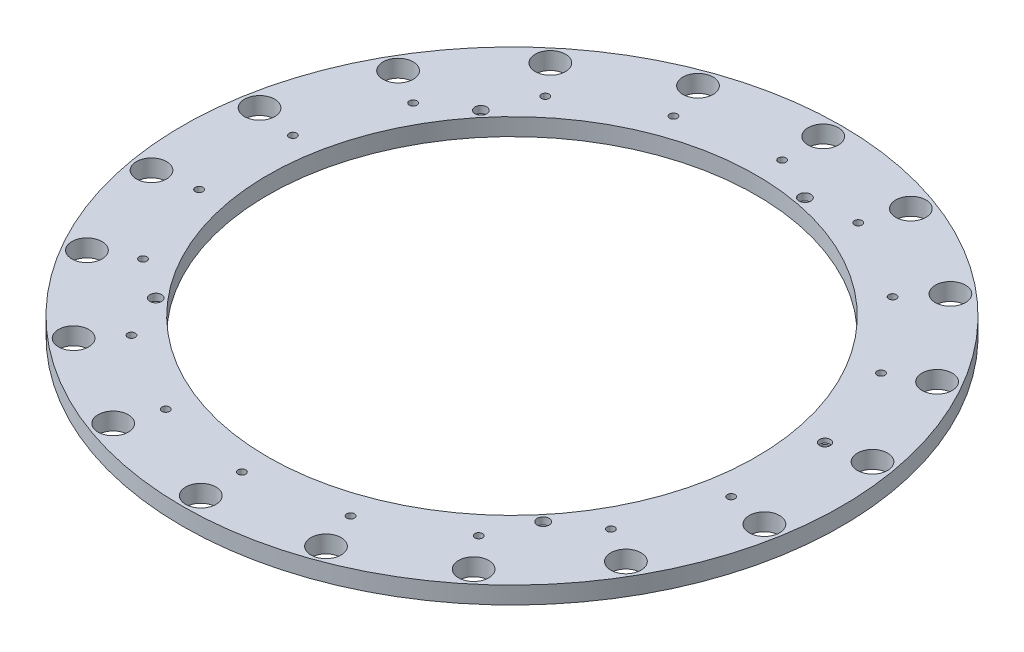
ISO-10303-21;
HEADER;
FILE_DESCRIPTION(('STEP AP214'),'2;1');
FILE_NAME('part.step','',(''),(''),'','','');
FILE_SCHEMA(('AUTOMOTIVE_DESIGN { 1 0 10303 214 1 1 1 1 }'));
ENDSEC;
DATA;
#1=APPLICATION_CONTEXT('core data for automotive mechanical design processes');
#2=APPLICATION_PROTOCOL_DEFINITION('international standard','automotive_design',2000,#1);
#3=PRODUCT_CONTEXT('',#1,'mechanical');
#4=PRODUCT('Part','Part','',(#3));
#5=PRODUCT_RELATED_PRODUCT_CATEGORY('part','',(#4));
#6=PRODUCT_DEFINITION_FORMATION('','',#4);
#7=PRODUCT_DEFINITION_CONTEXT('part definition',#1,'design');
#8=PRODUCT_DEFINITION('design','',#6,#7);
#9=PRODUCT_DEFINITION_SHAPE('','',#8);
#10=(LENGTH_UNIT() NAMED_UNIT(*) SI_UNIT(.MILLI.,.METRE.));
#11=(NAMED_UNIT(*) PLANE_ANGLE_UNIT() SI_UNIT($,.RADIAN.));
#12=(NAMED_UNIT(*) SI_UNIT($,.STERADIAN.) SOLID_ANGLE_UNIT());
#13=UNCERTAINTY_MEASURE_WITH_UNIT(LENGTH_MEASURE(1.E-05),#10,'distance_accuracy_value','');
#14=(GEOMETRIC_REPRESENTATION_CONTEXT(3) GLOBAL_UNCERTAINTY_ASSIGNED_CONTEXT((#13)) GLOBAL_UNIT_ASSIGNED_CONTEXT((#10,
#11,#12)) REPRESENTATION_CONTEXT('',''));
#15=CARTESIAN_POINT('',(0.,0.,0.));
#16=DIRECTION('',(0.,0.,1.));
#17=DIRECTION('',(1.,0.,0.));
#18=AXIS2_PLACEMENT_3D('',#15,#16,#17);
#19=CARTESIAN_POINT('',(0.,12.7,0.));
#20=DIRECTION('',(0.,1.,0.));
#21=DIRECTION('',(0.,0.,1.));
#22=AXIS2_PLACEMENT_3D('',#19,#20,#21);
#23=PLANE('',#22);
#24=CARTESIAN_POINT('',(127.553166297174,12.7,-152.011944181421));
#25=DIRECTION('',(0.,1.,0.));
#26=DIRECTION('',(0.,0.,1.));
#27=AXIS2_PLACEMENT_3D('',#24,#25,#26);
#28=CIRCLE('',#27,2.80670000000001);
#29=CARTESIAN_POINT('',(127.553166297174,12.7,-149.205244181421));
#30=VERTEX_POINT('',#29);
#31=EDGE_CURVE('E128',#30,#30,#28,.F.);
#32=ORIENTED_EDGE('',*,*,#31,.T.);
#33=EDGE_LOOP('',(#32));
#34=FACE_BOUND('',#33,.T.);
#35=CARTESIAN_POINT('',(1.83186799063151E-12,12.7,-198.4375));
#36=DIRECTION('',(0.,1.,0.));
#37=DIRECTION('',(0.,0.,1.));
#38=AXIS2_PLACEMENT_3D('',#35,#36,#37);
#39=CIRCLE('',#38,2.80670000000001);
#40=CARTESIAN_POINT('',(1.83186799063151E-12,12.7,-195.6308));
#41=VERTEX_POINT('',#40);
#42=EDGE_CURVE('E119',#41,#41,#39,.F.);
#43=ORIENTED_EDGE('',*,*,#42,.T.);
#44=EDGE_LOOP('',(#43));
#45=FACE_BOUND('',#44,.T.);
#46=CARTESIAN_POINT('',(-127.553166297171,12.7,-152.011944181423));
#47=DIRECTION('',(0.,1.,0.));
#48=DIRECTION('',(0.,0.,1.));
#49=AXIS2_PLACEMENT_3D('',#46,#47,#48);
#50=CIRCLE('',#49,2.80670000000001);
#51=CARTESIAN_POINT('',(-127.553166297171,12.7,-149.205244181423));
#52=VERTEX_POINT('',#51);
#53=EDGE_CURVE('E109',#52,#52,#50,.F.);
#54=ORIENTED_EDGE('',*,*,#53,.T.);
#55=EDGE_LOOP('',(#54));
#56=FACE_BOUND('',#55,.T.);
#57=CARTESIAN_POINT('',(-195.42278848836,12.7,-34.4583102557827));
#58=DIRECTION('',(0.,1.,0.));
#59=DIRECTION('',(0.,0.,1.));
#60=AXIS2_PLACEMENT_3D('',#57,#58,#59);
#61=CIRCLE('',#60,2.80670000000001);
#62=CARTESIAN_POINT('',(-195.42278848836,12.7,-31.6516102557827));
#63=VERTEX_POINT('',#62);
#64=EDGE_CURVE('E99',#63,#63,#61,.F.);
#65=ORIENTED_EDGE('',*,*,#64,.T.);
#66=EDGE_LOOP('',(#65));
#67=FACE_BOUND('',#66,.T.);
#68=CARTESIAN_POINT('',(-171.851916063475,12.7,99.2187499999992));
#69=DIRECTION('',(0.,1.,0.));
#70=DIRECTION('',(0.,0.,1.));
#71=AXIS2_PLACEMENT_3D('',#68,#69,#70);
#72=CIRCLE('',#71,2.80670000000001);
#73=CARTESIAN_POINT('',(-171.851916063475,12.7,102.025449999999));
#74=VERTEX_POINT('',#73);
#75=EDGE_CURVE('E88',#74,#74,#72,.F.);
#76=ORIENTED_EDGE('',*,*,#75,.T.);
#77=EDGE_LOOP('',(#76));
#78=FACE_BOUND('',#77,.T.);
#79=CARTESIAN_POINT('',(-67.8696221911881,12.7,186.470254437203));
#80=DIRECTION('',(0.,1.,0.));
#81=DIRECTION('',(0.,0.,1.));
#82=AXIS2_PLACEMENT_3D('',#79,#80,#81);
#83=CIRCLE('',#82,2.80670000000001);
#84=CARTESIAN_POINT('',(-67.8696221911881,12.7,189.276954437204));
#85=VERTEX_POINT('',#84);
#86=EDGE_CURVE('E77',#85,#85,#83,.F.);
#87=ORIENTED_EDGE('',*,*,#86,.T.);
#88=EDGE_LOOP('',(#87));
#89=FACE_BOUND('',#88,.T.);
#90=CARTESIAN_POINT('',(67.869622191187,12.7,186.470254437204));
#91=DIRECTION('',(0.,1.,0.));
#92=DIRECTION('',(0.,0.,1.));
#93=AXIS2_PLACEMENT_3D('',#90,#91,#92);
#94=CIRCLE('',#93,2.80670000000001);
#95=CARTESIAN_POINT('',(67.869622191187,12.7,189.276954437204));
#96=VERTEX_POINT('',#95);
#97=EDGE_CURVE('E66',#96,#96,#94,.F.);
#98=ORIENTED_EDGE('',*,*,#97,.T.);
#99=EDGE_LOOP('',(#98));
#100=FACE_BOUND('',#99,.T.);
#101=CARTESIAN_POINT('',(171.851916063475,12.7,99.2187500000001));
#102=DIRECTION('',(0.,1.,0.));
#103=DIRECTION('',(0.,0.,1.));
#104=AXIS2_PLACEMENT_3D('',#101,#102,#103);
#105=CIRCLE('',#104,2.80670000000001);
#106=CARTESIAN_POINT('',(171.851916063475,12.7,102.02545));
#107=VERTEX_POINT('',#106);
#108=EDGE_CURVE('E56',#107,#107,#105,.F.);
#109=ORIENTED_EDGE('',*,*,#108,.T.);
#110=EDGE_LOOP('',(#109));
#111=FACE_BOUND('',#110,.T.);
#112=CARTESIAN_POINT('',(142.283179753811,12.6999999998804,119.389763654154));
#113=DIRECTION('',(0.,-1.,0.));
#114=DIRECTION('',(0.,0.,-1.));
#115=AXIS2_PLACEMENT_3D('',#112,#113,#114);
#116=CIRCLE('',#115,4.365625);
#117=CARTESIAN_POINT('',(142.283179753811,12.6999999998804,115.024138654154));
#118=VERTEX_POINT('',#117);
#119=EDGE_CURVE('E376',#118,#118,#116,.T.);
#120=ORIENTED_EDGE('',*,*,#119,.T.);
#121=EDGE_LOOP('',(#120));
#122=FACE_BOUND('',#121,.T.);
#123=CARTESIAN_POINT('',(32.2529783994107,12.6999999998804,-182.915730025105));
#124=DIRECTION('',(0.,-1.,0.));
#125=DIRECTION('',(0.,0.,-1.));
#126=AXIS2_PLACEMENT_3D('',#123,#124,#125);
#127=CIRCLE('',#126,4.36562500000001);
#128=CARTESIAN_POINT('',(32.2529783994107,12.6999999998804,-187.281355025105));
#129=VERTEX_POINT('',#128);
#130=EDGE_CURVE('E395',#129,#129,#127,.T.);
#131=ORIENTED_EDGE('',*,*,#130,.T.);
#132=EDGE_LOOP('',(#131));
#133=FACE_BOUND('',#132,.T.);
#134=CARTESIAN_POINT('',(195.42278848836,12.6999999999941,-34.4583102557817));
#135=DIRECTION('',(0.,-1.,0.));
#136=DIRECTION('',(0.,0.,-1.));
#137=AXIS2_PLACEMENT_3D('',#134,#135,#136);
#138=CIRCLE('',#137,3.9878);
#139=CARTESIAN_POINT('',(195.42278848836,12.6999999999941,-38.4461102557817));
#140=VERTEX_POINT('',#139);
#141=EDGE_CURVE('E458',#140,#140,#138,.T.);
#142=ORIENTED_EDGE('',*,*,#141,.T.);
#143=EDGE_LOOP('',(#142));
#144=FACE_BOUND('',#143,.T.);
#145=CARTESIAN_POINT('',(225.127052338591,12.7,-39.6959734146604));
#146=DIRECTION('',(0.,1.,0.));
#147=DIRECTION('',(-1.,0.,0.));
#148=AXIS2_PLACEMENT_3D('',#145,#146,#147);
#149=CIRCLE('',#148,11.1125);
#150=CARTESIAN_POINT('',(214.014552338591,12.7,-39.6959734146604));
#151=VERTEX_POINT('',#150);
#152=EDGE_CURVE('E461',#151,#151,#149,.T.);
#153=ORIENTED_EDGE('',*,*,#152,.F.);
#154=EDGE_LOOP('',(#153));
#155=FACE_BOUND('',#154,.T.);
#156=CARTESIAN_POINT('',(0.,12.7,0.));
#157=DIRECTION('',(0.,1.,0.));
#158=DIRECTION('',(0.,0.,1.));
#159=AXIS2_PLACEMENT_3D('',#156,#157,#158);
#160=CIRCLE('',#159,242.09375);
#161=CARTESIAN_POINT('',(0.,12.7,242.09375));
#162=VERTEX_POINT('',#161);
#163=EDGE_CURVE('E10',#162,#162,#160,.T.);
#164=ORIENTED_EDGE('',*,*,#163,.T.);
#165=EDGE_LOOP('',(#164));
#166=FACE_BOUND('',#165,.T.);
#167=CARTESIAN_POINT('',(0.,12.7,0.));
#168=DIRECTION('',(0.,1.,0.));
#169=DIRECTION('',(0.,0.,1.));
#170=AXIS2_PLACEMENT_3D('',#167,#168,#169);
#171=CIRCLE('',#170,179.3875);
#172=CARTESIAN_POINT('',(0.,12.7,179.3875));
#173=VERTEX_POINT('',#172);
#174=EDGE_CURVE('E45',#173,#173,#171,.T.);
#175=ORIENTED_EDGE('',*,*,#174,.F.);
#176=EDGE_LOOP('',(#175));
#177=FACE_BOUND('',#176,.T.);
#178=CARTESIAN_POINT('',(-142.283179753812,12.6999999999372,-119.389763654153));
#179=DIRECTION('',(0.,-1.,0.));
#180=DIRECTION('',(0.,0.,-1.));
#181=AXIS2_PLACEMENT_3D('',#178,#179,#180);
#182=CIRCLE('',#181,4.365625);
#183=CARTESIAN_POINT('',(-142.283179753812,12.6999999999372,-123.755388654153));
#184=VERTEX_POINT('',#183);
#185=EDGE_CURVE('E404',#184,#184,#182,.T.);
#186=ORIENTED_EDGE('',*,*,#185,.T.);
#187=EDGE_LOOP('',(#186));
#188=FACE_BOUND('',#187,.T.);
#189=CARTESIAN_POINT('',(-142.283179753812,12.6999999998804,119.389763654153));
#190=DIRECTION('',(0.,-1.,0.));
#191=DIRECTION('',(0.,0.,-1.));
#192=AXIS2_PLACEMENT_3D('',#189,#190,#191);
#193=CIRCLE('',#192,4.365625);
#194=CARTESIAN_POINT('',(-142.283179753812,12.6999999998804,115.024138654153));
#195=VERTEX_POINT('',#194);
#196=EDGE_CURVE('E386',#195,#195,#193,.T.);
#197=ORIENTED_EDGE('',*,*,#196,.T.);
#198=EDGE_LOOP('',(#197));
#199=FACE_BOUND('',#198,.T.);
#200=CARTESIAN_POINT('',(225.127052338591,12.7,39.6959734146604));
#201=DIRECTION('',(0.,1.,0.));
#202=DIRECTION('',(-0.939692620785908,0.,-0.342020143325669));
#203=AXIS2_PLACEMENT_3D('',#200,#201,#202);
#204=CIRCLE('',#203,11.1125);
#205=CARTESIAN_POINT('',(214.684718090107,12.7,35.8952745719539));
#206=VERTEX_POINT('',#205);
#207=EDGE_CURVE('E361',#206,#206,#204,.T.);
#208=ORIENTED_EDGE('',*,*,#207,.F.);
#209=EDGE_LOOP('',(#208));
#210=FACE_BOUND('',#209,.T.);
#211=CARTESIAN_POINT('',(197.973407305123,12.7,114.3));
#212=DIRECTION('',(0.,1.,0.));
#213=DIRECTION('',(-0.766044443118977,0.,-0.642787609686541));
#214=AXIS2_PLACEMENT_3D('',#211,#212,#213);
#215=CIRCLE('',#214,11.1125);
#216=CARTESIAN_POINT('',(189.460738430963,12.7,107.157022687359));
#217=VERTEX_POINT('',#216);
#218=EDGE_CURVE('E354',#217,#217,#215,.T.);
#219=ORIENTED_EDGE('',*,*,#218,.F.);
#220=EDGE_LOOP('',(#219));
#221=FACE_BOUND('',#220,.T.);
#222=CARTESIAN_POINT('',(146.941247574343,12.7,175.117759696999));
#223=DIRECTION('',(0.,1.,0.));
#224=DIRECTION('',(-0.499999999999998,0.,-0.86602540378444));
#225=AXIS2_PLACEMENT_3D('',#222,#223,#224);
#226=CIRCLE('',#225,11.1125);
#227=CARTESIAN_POINT('',(141.384997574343,12.7,165.494052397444));
#228=VERTEX_POINT('',#227);
#229=EDGE_CURVE('E347',#228,#228,#226,.T.);
#230=ORIENTED_EDGE('',*,*,#229,.F.);
#231=EDGE_LOOP('',(#230));
#232=FACE_BOUND('',#231,.T.);
#233=CARTESIAN_POINT('',(78.1858047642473,12.7,214.813733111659));
#234=DIRECTION('',(0.,1.,0.));
#235=DIRECTION('',(-0.173648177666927,0.,-0.984807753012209));
#236=AXIS2_PLACEMENT_3D('',#233,#234,#235);
#237=CIRCLE('',#236,11.1125);
#238=CARTESIAN_POINT('',(76.2561393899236,12.7,203.870056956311));
#239=VERTEX_POINT('',#238);
#240=EDGE_CURVE('E339',#239,#239,#237,.T.);
#241=ORIENTED_EDGE('',*,*,#240,.F.);
#242=EDGE_LOOP('',(#241));
#243=FACE_BOUND('',#242,.T.);
#244=CARTESIAN_POINT('',(-7.56339435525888E-13,12.7,228.6));
#245=DIRECTION('',(0.,1.,0.));
#246=DIRECTION('',(0.173648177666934,0.,-0.984807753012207));
#247=AXIS2_PLACEMENT_3D('',#244,#245,#246);
#248=CIRCLE('',#247,11.1125);
#249=CARTESIAN_POINT('',(1.92966537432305,12.7,217.656323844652));
#250=VERTEX_POINT('',#249);
#251=EDGE_CURVE('E331',#250,#250,#248,.T.);
#252=ORIENTED_EDGE('',*,*,#251,.F.);
#253=EDGE_LOOP('',(#252));
#254=FACE_BOUND('',#253,.T.);
#255=CARTESIAN_POINT('',(-78.1858047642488,12.7,214.813733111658));
#256=DIRECTION('',(0.,1.,0.));
#257=DIRECTION('',(0.500000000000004,0.,-0.866025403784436));
#258=AXIS2_PLACEMENT_3D('',#255,#256,#257);
#259=CIRCLE('',#258,11.1125);
#260=CARTESIAN_POINT('',(-72.6295547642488,12.7,205.190025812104));
#261=VERTEX_POINT('',#260);
#262=EDGE_CURVE('E325',#261,#261,#259,.T.);
#263=ORIENTED_EDGE('',*,*,#262,.F.);
#264=EDGE_LOOP('',(#263));
#265=FACE_BOUND('',#264,.T.);
#266=CARTESIAN_POINT('',(-146.941247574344,12.7,175.117759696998));
#267=DIRECTION('',(0.,1.,0.));
#268=DIRECTION('',(0.766044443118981,0.,-0.642787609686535));
#269=AXIS2_PLACEMENT_3D('',#266,#267,#268);
#270=CIRCLE('',#269,11.1125);
#271=CARTESIAN_POINT('',(-138.428578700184,12.7,167.974782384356));
#272=VERTEX_POINT('',#271);
#273=EDGE_CURVE('E319',#272,#272,#270,.T.);
#274=ORIENTED_EDGE('',*,*,#273,.F.);
#275=EDGE_LOOP('',(#274));
#276=FACE_BOUND('',#275,.T.);
#277=CARTESIAN_POINT('',(-197.973407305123,12.7,114.299999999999));
#278=DIRECTION('',(0.,1.,0.));
#279=DIRECTION('',(0.939692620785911,0.,-0.342020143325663));
#280=AXIS2_PLACEMENT_3D('',#277,#278,#279);
#281=CIRCLE('',#280,11.1125);
#282=CARTESIAN_POINT('',(-187.53107305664,12.7,110.499301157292));
#283=VERTEX_POINT('',#282);
#284=EDGE_CURVE('E312',#283,#283,#281,.T.);
#285=ORIENTED_EDGE('',*,*,#284,.F.);
#286=EDGE_LOOP('',(#285));
#287=FACE_BOUND('',#286,.T.);
#288=CARTESIAN_POINT('',(-225.127052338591,12.7,39.6959734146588));
#289=DIRECTION('',(0.,1.,0.));
#290=DIRECTION('',(1.,0.,0.));
#291=AXIS2_PLACEMENT_3D('',#288,#289,#290);
#292=CIRCLE('',#291,11.1125);
#293=CARTESIAN_POINT('',(-214.014552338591,12.7,39.6959734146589));
#294=VERTEX_POINT('',#293);
#295=EDGE_CURVE('E305',#294,#294,#292,.T.);
#296=ORIENTED_EDGE('',*,*,#295,.F.);
#297=EDGE_LOOP('',(#296));
#298=FACE_BOUND('',#297,.T.);
#299=CARTESIAN_POINT('',(-225.127052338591,12.7,-39.6959734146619));
#300=DIRECTION('',(0.,1.,0.));
#301=DIRECTION('',(0.939692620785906,0.,0.342020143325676));
#302=AXIS2_PLACEMENT_3D('',#299,#300,#301);
#303=CIRCLE('',#302,11.1125);
#304=CARTESIAN_POINT('',(-214.684718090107,12.7,-35.8952745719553));
#305=VERTEX_POINT('',#304);
#306=EDGE_CURVE('E299',#305,#305,#303,.T.);
#307=ORIENTED_EDGE('',*,*,#306,.F.);
#308=EDGE_LOOP('',(#307));
#309=FACE_BOUND('',#308,.T.);
#310=CARTESIAN_POINT('',(-197.973407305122,12.7,-114.300000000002));
#311=DIRECTION('',(0.,1.,0.));
#312=DIRECTION('',(0.766044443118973,0.,0.642787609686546));
#313=AXIS2_PLACEMENT_3D('',#310,#311,#312);
#314=CIRCLE('',#313,11.1125);
#315=CARTESIAN_POINT('',(-189.460738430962,12.7,-107.15702268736));
#316=VERTEX_POINT('',#315);
#317=EDGE_CURVE('E293',#316,#316,#314,.T.);
#318=ORIENTED_EDGE('',*,*,#317,.F.);
#319=EDGE_LOOP('',(#318));
#320=FACE_BOUND('',#319,.T.);
#321=CARTESIAN_POINT('',(-146.941247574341,12.7,-175.117759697));
#322=DIRECTION('',(0.,1.,0.));
#323=DIRECTION('',(0.499999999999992,0.,0.866025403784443));
#324=AXIS2_PLACEMENT_3D('',#321,#322,#323);
#325=CIRCLE('',#324,11.1125);
#326=CARTESIAN_POINT('',(-141.384997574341,12.7,-165.494052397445));
#327=VERTEX_POINT('',#326);
#328=EDGE_CURVE('E287',#327,#327,#325,.T.);
#329=ORIENTED_EDGE('',*,*,#328,.F.);
#330=EDGE_LOOP('',(#329));
#331=FACE_BOUND('',#330,.T.);
#332=CARTESIAN_POINT('',(-78.1858047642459,12.7,-214.813733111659));
#333=DIRECTION('',(0.,1.,0.));
#334=DIRECTION('',(0.173648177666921,0.,0.98480775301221));
#335=AXIS2_PLACEMENT_3D('',#332,#333,#334);
#336=CIRCLE('',#335,11.1125);
#337=CARTESIAN_POINT('',(-76.2561393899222,12.7,-203.870056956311));
#338=VERTEX_POINT('',#337);
#339=EDGE_CURVE('E281',#338,#338,#336,.T.);
#340=ORIENTED_EDGE('',*,*,#339,.F.);
#341=EDGE_LOOP('',(#340));
#342=FACE_BOUND('',#341,.T.);
#343=CARTESIAN_POINT('',(2.25514051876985E-12,12.7,-228.6));
#344=DIRECTION('',(0.,1.,0.));
#345=DIRECTION('',(-0.17364817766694,0.,0.984807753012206));
#346=AXIS2_PLACEMENT_3D('',#343,#344,#345);
#347=CIRCLE('',#346,11.1125);
#348=CARTESIAN_POINT('',(-1.92966537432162,12.7,-217.656323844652));
#349=VERTEX_POINT('',#348);
#350=EDGE_CURVE('E274',#349,#349,#347,.T.);
#351=ORIENTED_EDGE('',*,*,#350,.F.);
#352=EDGE_LOOP('',(#351));
#353=FACE_BOUND('',#352,.T.);
#354=CARTESIAN_POINT('',(78.1858047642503,12.7,-214.813733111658));
#355=DIRECTION('',(0.,1.,0.));
#356=DIRECTION('',(-0.50000000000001,0.,0.866025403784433));
#357=AXIS2_PLACEMENT_3D('',#354,#355,#356);
#358=CIRCLE('',#357,11.1125);
#359=CARTESIAN_POINT('',(72.6295547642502,12.7,-205.190025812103));
#360=VERTEX_POINT('',#359);
#361=EDGE_CURVE('E268',#360,#360,#358,.T.);
#362=ORIENTED_EDGE('',*,*,#361,.F.);
#363=EDGE_LOOP('',(#362));
#364=FACE_BOUND('',#363,.T.);
#365=CARTESIAN_POINT('',(146.941247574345,12.7,-175.117759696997));
#366=DIRECTION('',(0.,1.,0.));
#367=DIRECTION('',(-0.766044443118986,0.,0.64278760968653));
#368=AXIS2_PLACEMENT_3D('',#365,#366,#367);
#369=CIRCLE('',#368,11.1125);
#370=CARTESIAN_POINT('',(138.428578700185,12.7,-167.974782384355));
#371=VERTEX_POINT('',#370);
#372=EDGE_CURVE('E262',#371,#371,#369,.T.);
#373=ORIENTED_EDGE('',*,*,#372,.F.);
#374=EDGE_LOOP('',(#373));
#375=FACE_BOUND('',#374,.T.);
#376=CARTESIAN_POINT('',(197.973407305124,12.7,-114.299999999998));
#377=DIRECTION('',(0.,1.,0.));
#378=DIRECTION('',(-0.939692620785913,0.,0.342020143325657));
#379=AXIS2_PLACEMENT_3D('',#376,#377,#378);
#380=CIRCLE('',#379,11.1125);
#381=CARTESIAN_POINT('',(187.531073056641,12.7,-110.499301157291));
#382=VERTEX_POINT('',#381);
#383=EDGE_CURVE('E54',#382,#382,#380,.T.);
#384=ORIENTED_EDGE('',*,*,#383,.F.);
#385=EDGE_LOOP('',(#384));
#386=FACE_BOUND('',#385,.T.);
#387=CARTESIAN_POINT('',(195.42278848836,12.7,34.4583102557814));
#388=DIRECTION('',(0.,1.,0.));
#389=DIRECTION('',(0.,0.,1.));
#390=AXIS2_PLACEMENT_3D('',#387,#388,#389);
#391=CIRCLE('',#390,2.80670000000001);
#392=CARTESIAN_POINT('',(195.42278848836,12.7,37.2650102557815));
#393=VERTEX_POINT('',#392);
#394=EDGE_CURVE('E51',#393,#393,#391,.F.);
#395=ORIENTED_EDGE('',*,*,#394,.T.);
#396=EDGE_LOOP('',(#395));
#397=FACE_BOUND('',#396,.T.);
#398=CARTESIAN_POINT('',(127.553166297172,12.7,152.011944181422));
#399=DIRECTION('',(0.,1.,0.));
#400=DIRECTION('',(0.,0.,1.));
#401=AXIS2_PLACEMENT_3D('',#398,#399,#400);
#402=CIRCLE('',#401,2.80670000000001);
#403=CARTESIAN_POINT('',(127.553166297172,12.7,154.818644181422));
#404=VERTEX_POINT('',#403);
#405=EDGE_CURVE('E61',#404,#404,#402,.F.);
#406=ORIENTED_EDGE('',*,*,#405,.T.);
#407=EDGE_LOOP('',(#406));
#408=FACE_BOUND('',#407,.T.);
#409=CARTESIAN_POINT('',(-5.34294830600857E-13,12.7,198.4375));
#410=DIRECTION('',(0.,1.,0.));
#411=DIRECTION('',(0.,0.,1.));
#412=AXIS2_PLACEMENT_3D('',#409,#410,#411);
#413=CIRCLE('',#412,2.80670000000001);
#414=CARTESIAN_POINT('',(-5.34294830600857E-13,12.7,201.2442));
#415=VERTEX_POINT('',#414);
#416=EDGE_CURVE('E71',#415,#415,#413,.F.);
#417=ORIENTED_EDGE('',*,*,#416,.T.);
#418=EDGE_LOOP('',(#417));
#419=FACE_BOUND('',#418,.T.);
#420=CARTESIAN_POINT('',(-127.553166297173,12.7,152.011944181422));
#421=DIRECTION('',(0.,1.,0.));
#422=DIRECTION('',(0.,0.,1.));
#423=AXIS2_PLACEMENT_3D('',#420,#421,#422);
#424=CIRCLE('',#423,2.80670000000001);
#425=CARTESIAN_POINT('',(-127.553166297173,12.7,154.818644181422));
#426=VERTEX_POINT('',#425);
#427=EDGE_CURVE('E82',#426,#426,#424,.F.);
#428=ORIENTED_EDGE('',*,*,#427,.T.);
#429=EDGE_LOOP('',(#428));
#430=FACE_BOUND('',#429,.T.);
#431=CARTESIAN_POINT('',(-195.42278848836,12.7,34.4583102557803));
#432=DIRECTION('',(0.,1.,0.));
#433=DIRECTION('',(0.,0.,1.));
#434=AXIS2_PLACEMENT_3D('',#431,#432,#433);
#435=CIRCLE('',#434,2.80670000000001);
#436=CARTESIAN_POINT('',(-195.42278848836,12.7,37.2650102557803));
#437=VERTEX_POINT('',#436);
#438=EDGE_CURVE('E94',#437,#437,#435,.F.);
#439=ORIENTED_EDGE('',*,*,#438,.T.);
#440=EDGE_LOOP('',(#439));
#441=FACE_BOUND('',#440,.T.);
#442=CARTESIAN_POINT('',(-171.851916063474,12.7,-99.2187500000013));
#443=DIRECTION('',(0.,1.,0.));
#444=DIRECTION('',(0.,0.,1.));
#445=AXIS2_PLACEMENT_3D('',#442,#443,#444);
#446=CIRCLE('',#445,2.80670000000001);
#447=CARTESIAN_POINT('',(-171.851916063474,12.7,-96.4120500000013));
#448=VERTEX_POINT('',#447);
#449=EDGE_CURVE('E104',#448,#448,#446,.F.);
#450=ORIENTED_EDGE('',*,*,#449,.T.);
#451=EDGE_LOOP('',(#450));
#452=FACE_BOUND('',#451,.T.);
#453=CARTESIAN_POINT('',(-67.8696221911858,12.7,-186.470254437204));
#454=DIRECTION('',(0.,1.,0.));
#455=DIRECTION('',(0.,0.,1.));
#456=AXIS2_PLACEMENT_3D('',#453,#454,#455);
#457=CIRCLE('',#456,2.80670000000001);
#458=CARTESIAN_POINT('',(-67.8696221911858,12.7,-183.663554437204));
#459=VERTEX_POINT('',#458);
#460=EDGE_CURVE('E114',#459,#459,#457,.F.);
#461=ORIENTED_EDGE('',*,*,#460,.T.);
#462=EDGE_LOOP('',(#461));
#463=FACE_BOUND('',#462,.T.);
#464=CARTESIAN_POINT('',(67.8696221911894,12.7,-186.470254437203));
#465=DIRECTION('',(0.,1.,0.));
#466=DIRECTION('',(0.,0.,1.));
#467=AXIS2_PLACEMENT_3D('',#464,#465,#466);
#468=CIRCLE('',#467,2.80670000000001);
#469=CARTESIAN_POINT('',(67.8696221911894,12.7,-183.663554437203));
#470=VERTEX_POINT('',#469);
#471=EDGE_CURVE('E124',#470,#470,#468,.F.);
#472=ORIENTED_EDGE('',*,*,#471,.T.);
#473=EDGE_LOOP('',(#472));
#474=FACE_BOUND('',#473,.T.);
#475=CARTESIAN_POINT('',(171.851916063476,12.7,-99.218749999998));
#476=DIRECTION('',(0.,1.,0.));
#477=DIRECTION('',(0.,0.,1.));
#478=AXIS2_PLACEMENT_3D('',#475,#476,#477);
#479=CIRCLE('',#478,2.80670000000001);
#480=CARTESIAN_POINT('',(171.851916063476,12.7,-96.412049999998));
#481=VERTEX_POINT('',#480);
#482=EDGE_CURVE('E36',#481,#481,#479,.F.);
#483=ORIENTED_EDGE('',*,*,#482,.T.);
#484=EDGE_LOOP('',(#483));
#485=FACE_BOUND('',#484,.T.);
#486=ADVANCED_FACE('F32',(#34,#45,#56,#67,#78,#89,#100,#111,#122,#133,#144,#155,#166,#177,#188,
#199,#210,#221,#232,#243,#254,#265,#276,#287,#298,#309,#320,#331,#342,#353,#364,#375,#386,#397,
#408,#419,#430,#441,#452,#463,#474,#485),#23,.T.);
#487=CARTESIAN_POINT('',(0.,0.,0.));
#488=DIRECTION('',(0.,1.,0.));
#489=DIRECTION('',(0.,0.,1.));
#490=AXIS2_PLACEMENT_3D('',#487,#488,#489);
#491=PLANE('',#490);
#492=CARTESIAN_POINT('',(127.553166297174,0.,-152.011944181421));
#493=DIRECTION('',(0.,1.,0.));
#494=DIRECTION('',(0.64278760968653,0.,0.766044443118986));
#495=AXIS2_PLACEMENT_3D('',#492,#493,#494);
#496=CIRCLE('',#495,4.365625);
#497=CARTESIAN_POINT('',(130.359335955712,0.,-148.66768140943));
#498=VERTEX_POINT('',#497);
#499=EDGE_CURVE('E143',#498,#498,#496,.T.);
#500=ORIENTED_EDGE('',*,*,#499,.T.);
#501=EDGE_LOOP('',(#500));
#502=FACE_BOUND('',#501,.T.);
#503=CARTESIAN_POINT('',(1.83186799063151E-12,0.,-198.4375));
#504=DIRECTION('',(0.,1.,0.));
#505=DIRECTION('',(0.984807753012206,0.,0.17364817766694));
#506=AXIS2_PLACEMENT_3D('',#503,#504,#505);
#507=CIRCLE('',#506,4.365625);
#508=CARTESIAN_POINT('',(4.29930134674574,0.,-197.679417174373));
#509=VERTEX_POINT('',#508);
#510=EDGE_CURVE('E126',#509,#509,#507,.T.);
#511=ORIENTED_EDGE('',*,*,#510,.T.);
#512=EDGE_LOOP('',(#511));
#513=FACE_BOUND('',#512,.T.);
#514=CARTESIAN_POINT('',(-127.553166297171,0.,-152.011944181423));
#515=DIRECTION('',(0.,1.,0.));
#516=DIRECTION('',(0.866025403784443,0.,-0.499999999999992));
#517=AXIS2_PLACEMENT_3D('',#514,#515,#516);
#518=CIRCLE('',#517,4.365625);
#519=CARTESIAN_POINT('',(-123.772424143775,0.,-154.194756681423));
#520=VERTEX_POINT('',#519);
#521=EDGE_CURVE('E117',#520,#520,#518,.T.);
#522=ORIENTED_EDGE('',*,*,#521,.T.);
#523=EDGE_LOOP('',(#522));
#524=FACE_BOUND('',#523,.T.);
#525=CARTESIAN_POINT('',(-195.42278848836,0.,-34.4583102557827));
#526=DIRECTION('',(0.,1.,0.));
#527=DIRECTION('',(0.342020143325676,0.,-0.939692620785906));
#528=AXIS2_PLACEMENT_3D('',#525,#526,#527);
#529=CIRCLE('',#528,4.365625);
#530=CARTESIAN_POINT('',(-193.929656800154,0.,-38.5606558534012));
#531=VERTEX_POINT('',#530);
#532=EDGE_CURVE('E107',#531,#531,#529,.T.);
#533=ORIENTED_EDGE('',*,*,#532,.T.);
#534=EDGE_LOOP('',(#533));
#535=FACE_BOUND('',#534,.T.);
#536=CARTESIAN_POINT('',(-171.851916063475,0.,99.2187499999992));
#537=DIRECTION('',(0.,1.,0.));
#538=DIRECTION('',(-0.342020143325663,0.,-0.939692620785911));
#539=AXIS2_PLACEMENT_3D('',#536,#537,#538);
#540=CIRCLE('',#539,4.365625);
#541=CARTESIAN_POINT('',(-173.345047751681,0.,95.1164044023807));
#542=VERTEX_POINT('',#541);
#543=EDGE_CURVE('E97',#542,#542,#540,.T.);
#544=ORIENTED_EDGE('',*,*,#543,.T.);
#545=EDGE_LOOP('',(#544));
#546=FACE_BOUND('',#545,.T.);
#547=CARTESIAN_POINT('',(-67.8696221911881,0.,186.470254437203));
#548=DIRECTION('',(0.,1.,0.));
#549=DIRECTION('',(-0.866025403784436,0.,-0.500000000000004));
#550=AXIS2_PLACEMENT_3D('',#547,#548,#549);
#551=CIRCLE('',#550,4.365625);
#552=CARTESIAN_POINT('',(-71.6503643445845,0.,184.287441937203));
#553=VERTEX_POINT('',#552);
#554=EDGE_CURVE('E86',#553,#553,#551,.T.);
#555=ORIENTED_EDGE('',*,*,#554,.T.);
#556=EDGE_LOOP('',(#555));
#557=FACE_BOUND('',#556,.T.);
#558=CARTESIAN_POINT('',(67.869622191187,0.,186.470254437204));
#559=DIRECTION('',(0.,1.,0.));
#560=DIRECTION('',(-0.984807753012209,0.,0.173648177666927));
#561=AXIS2_PLACEMENT_3D('',#558,#559,#560);
#562=CIRCLE('',#561,4.365625);
#563=CARTESIAN_POINT('',(63.5703208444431,0.,187.228337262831));
#564=VERTEX_POINT('',#563);
#565=EDGE_CURVE('E75',#564,#564,#562,.T.);
#566=ORIENTED_EDGE('',*,*,#565,.T.);
#567=EDGE_LOOP('',(#566));
#568=FACE_BOUND('',#567,.T.);
#569=CARTESIAN_POINT('',(171.851916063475,0.,99.2187500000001));
#570=DIRECTION('',(0.,1.,0.));
#571=DIRECTION('',(-0.642787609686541,0.,0.766044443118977));
#572=AXIS2_PLACEMENT_3D('',#569,#570,#571);
#573=CIRCLE('',#572,4.365625);
#574=CARTESIAN_POINT('',(169.045746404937,0.,102.563012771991));
#575=VERTEX_POINT('',#574);
#576=EDGE_CURVE('E64',#575,#575,#573,.T.);
#577=ORIENTED_EDGE('',*,*,#576,.T.);
#578=EDGE_LOOP('',(#577));
#579=FACE_BOUND('',#578,.T.);
#580=CARTESIAN_POINT('',(32.2529783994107,0.,-182.915730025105));
#581=DIRECTION('',(0.,1.,0.));
#582=DIRECTION('',(0.,0.,1.));
#583=AXIS2_PLACEMENT_3D('',#580,#581,#582);
#584=CIRCLE('',#583,3.98779999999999);
#585=CARTESIAN_POINT('',(32.2529783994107,0.,-178.927930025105));
#586=VERTEX_POINT('',#585);
#587=EDGE_CURVE('E407',#586,#586,#584,.T.);
#588=ORIENTED_EDGE('',*,*,#587,.T.);
#589=EDGE_LOOP('',(#588));
#590=FACE_BOUND('',#589,.T.);
#591=CARTESIAN_POINT('',(-142.283179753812,0.,119.389763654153));
#592=DIRECTION('',(0.,1.,0.));
#593=DIRECTION('',(0.,0.,1.));
#594=AXIS2_PLACEMENT_3D('',#591,#592,#593);
#595=CIRCLE('',#594,3.9878);
#596=CARTESIAN_POINT('',(-142.283179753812,0.,123.377563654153));
#597=VERTEX_POINT('',#596);
#598=EDGE_CURVE('E425',#597,#597,#595,.T.);
#599=ORIENTED_EDGE('',*,*,#598,.T.);
#600=EDGE_LOOP('',(#599));
#601=FACE_BOUND('',#600,.T.);
#602=CARTESIAN_POINT('',(195.42278848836,0.,-34.4583102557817));
#603=DIRECTION('',(0.,1.,0.));
#604=DIRECTION('',(0.,0.,1.));
#605=AXIS2_PLACEMENT_3D('',#602,#603,#604);
#606=CIRCLE('',#605,4.365625);
#607=CARTESIAN_POINT('',(195.42278848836,0.,-30.0926852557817));
#608=VERTEX_POINT('',#607);
#609=EDGE_CURVE('E443',#608,#608,#606,.T.);
#610=ORIENTED_EDGE('',*,*,#609,.T.);
#611=EDGE_LOOP('',(#610));
#612=FACE_BOUND('',#611,.T.);
#613=CARTESIAN_POINT('',(0.,0.,0.));
#614=DIRECTION('',(0.,1.,0.));
#615=DIRECTION('',(0.,0.,1.));
#616=AXIS2_PLACEMENT_3D('',#613,#614,#615);
#617=CIRCLE('',#616,179.3875);
#618=CARTESIAN_POINT('',(0.,0.,179.3875));
#619=VERTEX_POINT('',#618);
#620=EDGE_CURVE('E48',#619,#619,#617,.T.);
#621=ORIENTED_EDGE('',*,*,#620,.T.);
#622=EDGE_LOOP('',(#621));
#623=FACE_BOUND('',#622,.T.);
#624=CARTESIAN_POINT('',(0.,0.,0.));
#625=DIRECTION('',(0.,1.,0.));
#626=DIRECTION('',(0.,0.,1.));
#627=AXIS2_PLACEMENT_3D('',#624,#625,#626);
#628=CIRCLE('',#627,242.09375);
#629=CARTESIAN_POINT('',(0.,0.,242.09375));
#630=VERTEX_POINT('',#629);
#631=EDGE_CURVE('E40',#630,#630,#628,.T.);
#632=ORIENTED_EDGE('',*,*,#631,.F.);
#633=EDGE_LOOP('',(#632));
#634=FACE_BOUND('',#633,.T.);
#635=CARTESIAN_POINT('',(225.127052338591,0.,-39.6959734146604));
#636=DIRECTION('',(0.,1.,0.));
#637=DIRECTION('',(-1.,0.,0.));
#638=AXIS2_PLACEMENT_3D('',#635,#636,#637);
#639=CIRCLE('',#638,11.1125);
#640=CARTESIAN_POINT('',(214.014552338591,0.,-39.6959734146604));
#641=VERTEX_POINT('',#640);
#642=EDGE_CURVE('E462',#641,#641,#639,.T.);
#643=ORIENTED_EDGE('',*,*,#642,.T.);
#644=EDGE_LOOP('',(#643));
#645=FACE_BOUND('',#644,.T.);
#646=CARTESIAN_POINT('',(142.283179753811,0.,119.389763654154));
#647=DIRECTION('',(0.,1.,0.));
#648=DIRECTION('',(0.,0.,1.));
#649=AXIS2_PLACEMENT_3D('',#646,#647,#648);
#650=CIRCLE('',#649,3.9878);
#651=CARTESIAN_POINT('',(142.283179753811,0.,123.377563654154));
#652=VERTEX_POINT('',#651);
#653=EDGE_CURVE('E434',#652,#652,#650,.T.);
#654=ORIENTED_EDGE('',*,*,#653,.T.);
#655=EDGE_LOOP('',(#654));
#656=FACE_BOUND('',#655,.T.);
#657=CARTESIAN_POINT('',(-142.283179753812,0.,-119.389763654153));
#658=DIRECTION('',(0.,1.,0.));
#659=DIRECTION('',(0.,0.,1.));
#660=AXIS2_PLACEMENT_3D('',#657,#658,#659);
#661=CIRCLE('',#660,3.9878);
#662=CARTESIAN_POINT('',(-142.283179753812,0.,-115.401963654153));
#663=VERTEX_POINT('',#662);
#664=EDGE_CURVE('E416',#663,#663,#661,.T.);
#665=ORIENTED_EDGE('',*,*,#664,.T.);
#666=EDGE_LOOP('',(#665));
#667=FACE_BOUND('',#666,.T.);
#668=CARTESIAN_POINT('',(225.127052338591,0.,39.6959734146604));
#669=DIRECTION('',(0.,1.,0.));
#670=DIRECTION('',(-0.939692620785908,0.,-0.342020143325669));
#671=AXIS2_PLACEMENT_3D('',#668,#669,#670);
#672=CIRCLE('',#671,11.1125);
#673=CARTESIAN_POINT('',(214.684718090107,0.,35.8952745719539));
#674=VERTEX_POINT('',#673);
#675=EDGE_CURVE('E365',#674,#674,#672,.T.);
#676=ORIENTED_EDGE('',*,*,#675,.T.);
#677=EDGE_LOOP('',(#676));
#678=FACE_BOUND('',#677,.T.);
#679=CARTESIAN_POINT('',(197.973407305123,0.,114.3));
#680=DIRECTION('',(0.,1.,0.));
#681=DIRECTION('',(-0.766044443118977,0.,-0.642787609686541));
#682=AXIS2_PLACEMENT_3D('',#679,#680,#681);
#683=CIRCLE('',#682,11.1125);
#684=CARTESIAN_POINT('',(189.460738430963,0.,107.157022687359));
#685=VERTEX_POINT('',#684);
#686=EDGE_CURVE('E358',#685,#685,#683,.T.);
#687=ORIENTED_EDGE('',*,*,#686,.T.);
#688=EDGE_LOOP('',(#687));
#689=FACE_BOUND('',#688,.T.);
#690=CARTESIAN_POINT('',(146.941247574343,0.,175.117759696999));
#691=DIRECTION('',(0.,1.,0.));
#692=DIRECTION('',(-0.499999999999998,0.,-0.86602540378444));
#693=AXIS2_PLACEMENT_3D('',#690,#691,#692);
#694=CIRCLE('',#693,11.1125);
#695=CARTESIAN_POINT('',(141.384997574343,0.,165.494052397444));
#696=VERTEX_POINT('',#695);
#697=EDGE_CURVE('E351',#696,#696,#694,.T.);
#698=ORIENTED_EDGE('',*,*,#697,.T.);
#699=EDGE_LOOP('',(#698));
#700=FACE_BOUND('',#699,.T.);
#701=CARTESIAN_POINT('',(78.1858047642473,0.,214.813733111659));
#702=DIRECTION('',(0.,1.,0.));
#703=DIRECTION('',(-0.173648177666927,0.,-0.984807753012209));
#704=AXIS2_PLACEMENT_3D('',#701,#702,#703);
#705=CIRCLE('',#704,11.1125);
#706=CARTESIAN_POINT('',(76.2561393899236,0.,203.870056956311));
#707=VERTEX_POINT('',#706);
#708=EDGE_CURVE('E343',#707,#707,#705,.T.);
#709=ORIENTED_EDGE('',*,*,#708,.T.);
#710=EDGE_LOOP('',(#709));
#711=FACE_BOUND('',#710,.T.);
#712=CARTESIAN_POINT('',(-7.56339435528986E-13,0.,228.6));
#713=DIRECTION('',(0.,1.,0.));
#714=DIRECTION('',(0.173648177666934,0.,-0.984807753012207));
#715=AXIS2_PLACEMENT_3D('',#712,#713,#714);
#716=CIRCLE('',#715,11.1125);
#717=CARTESIAN_POINT('',(1.92966537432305,0.,217.656323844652));
#718=VERTEX_POINT('',#717);
#719=EDGE_CURVE('E335',#718,#718,#716,.T.);
#720=ORIENTED_EDGE('',*,*,#719,.T.);
#721=EDGE_LOOP('',(#720));
#722=FACE_BOUND('',#721,.T.);
#723=CARTESIAN_POINT('',(-78.1858047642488,0.,214.813733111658));
#724=DIRECTION('',(0.,1.,0.));
#725=DIRECTION('',(0.500000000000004,0.,-0.866025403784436));
#726=AXIS2_PLACEMENT_3D('',#723,#724,#725);
#727=CIRCLE('',#726,11.1125);
#728=CARTESIAN_POINT('',(-72.6295547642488,0.,205.190025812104));
#729=VERTEX_POINT('',#728);
#730=EDGE_CURVE('E328',#729,#729,#727,.T.);
#731=ORIENTED_EDGE('',*,*,#730,.T.);
#732=EDGE_LOOP('',(#731));
#733=FACE_BOUND('',#732,.T.);
#734=CARTESIAN_POINT('',(-146.941247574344,0.,175.117759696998));
#735=DIRECTION('',(0.,1.,0.));
#736=DIRECTION('',(0.766044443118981,0.,-0.642787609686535));
#737=AXIS2_PLACEMENT_3D('',#734,#735,#736);
#738=CIRCLE('',#737,11.1125);
#739=CARTESIAN_POINT('',(-138.428578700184,0.,167.974782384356));
#740=VERTEX_POINT('',#739);
#741=EDGE_CURVE('E322',#740,#740,#738,.T.);
#742=ORIENTED_EDGE('',*,*,#741,.T.);
#743=EDGE_LOOP('',(#742));
#744=FACE_BOUND('',#743,.T.);
#745=CARTESIAN_POINT('',(-197.973407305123,0.,114.299999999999));
#746=DIRECTION('',(0.,1.,0.));
#747=DIRECTION('',(0.939692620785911,0.,-0.342020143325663));
#748=AXIS2_PLACEMENT_3D('',#745,#746,#747);
#749=CIRCLE('',#748,11.1125);
#750=CARTESIAN_POINT('',(-187.53107305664,0.,110.499301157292));
#751=VERTEX_POINT('',#750);
#752=EDGE_CURVE('E316',#751,#751,#749,.T.);
#753=ORIENTED_EDGE('',*,*,#752,.T.);
#754=EDGE_LOOP('',(#753));
#755=FACE_BOUND('',#754,.T.);
#756=CARTESIAN_POINT('',(-225.127052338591,0.,39.6959734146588));
#757=DIRECTION('',(0.,1.,0.));
#758=DIRECTION('',(1.,0.,0.));
#759=AXIS2_PLACEMENT_3D('',#756,#757,#758);
#760=CIRCLE('',#759,11.1125);
#761=CARTESIAN_POINT('',(-214.014552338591,0.,39.6959734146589));
#762=VERTEX_POINT('',#761);
#763=EDGE_CURVE('E308',#762,#762,#760,.T.);
#764=ORIENTED_EDGE('',*,*,#763,.T.);
#765=EDGE_LOOP('',(#764));
#766=FACE_BOUND('',#765,.T.);
#767=CARTESIAN_POINT('',(-225.127052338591,0.,-39.6959734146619));
#768=DIRECTION('',(0.,1.,0.));
#769=DIRECTION('',(0.939692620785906,0.,0.342020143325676));
#770=AXIS2_PLACEMENT_3D('',#767,#768,#769);
#771=CIRCLE('',#770,11.1125);
#772=CARTESIAN_POINT('',(-214.684718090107,0.,-35.8952745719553));
#773=VERTEX_POINT('',#772);
#774=EDGE_CURVE('E302',#773,#773,#771,.T.);
#775=ORIENTED_EDGE('',*,*,#774,.T.);
#776=EDGE_LOOP('',(#775));
#777=FACE_BOUND('',#776,.T.);
#778=CARTESIAN_POINT('',(-197.973407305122,0.,-114.300000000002));
#779=DIRECTION('',(0.,1.,0.));
#780=DIRECTION('',(0.766044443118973,0.,0.642787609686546));
#781=AXIS2_PLACEMENT_3D('',#778,#779,#780);
#782=CIRCLE('',#781,11.1125);
#783=CARTESIAN_POINT('',(-189.460738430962,0.,-107.15702268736));
#784=VERTEX_POINT('',#783);
#785=EDGE_CURVE('E296',#784,#784,#782,.T.);
#786=ORIENTED_EDGE('',*,*,#785,.T.);
#787=EDGE_LOOP('',(#786));
#788=FACE_BOUND('',#787,.T.);
#789=CARTESIAN_POINT('',(-146.941247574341,0.,-175.117759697));
#790=DIRECTION('',(0.,1.,0.));
#791=DIRECTION('',(0.499999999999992,0.,0.866025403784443));
#792=AXIS2_PLACEMENT_3D('',#789,#790,#791);
#793=CIRCLE('',#792,11.1125);
#794=CARTESIAN_POINT('',(-141.384997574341,0.,-165.494052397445));
#795=VERTEX_POINT('',#794);
#796=EDGE_CURVE('E290',#795,#795,#793,.T.);
#797=ORIENTED_EDGE('',*,*,#796,.T.);
#798=EDGE_LOOP('',(#797));
#799=FACE_BOUND('',#798,.T.);
#800=CARTESIAN_POINT('',(-78.1858047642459,0.,-214.813733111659));
#801=DIRECTION('',(0.,1.,0.));
#802=DIRECTION('',(0.173648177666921,0.,0.98480775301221));
#803=AXIS2_PLACEMENT_3D('',#800,#801,#802);
#804=CIRCLE('',#803,11.1125);
#805=CARTESIAN_POINT('',(-76.2561393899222,0.,-203.870056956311));
#806=VERTEX_POINT('',#805);
#807=EDGE_CURVE('E284',#806,#806,#804,.T.);
#808=ORIENTED_EDGE('',*,*,#807,.T.);
#809=EDGE_LOOP('',(#808));
#810=FACE_BOUND('',#809,.T.);
#811=CARTESIAN_POINT('',(2.25514051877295E-12,0.,-228.6));
#812=DIRECTION('',(0.,1.,0.));
#813=DIRECTION('',(-0.17364817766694,0.,0.984807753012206));
#814=AXIS2_PLACEMENT_3D('',#811,#812,#813);
#815=CIRCLE('',#814,11.1125);
#816=CARTESIAN_POINT('',(-1.92966537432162,0.,-217.656323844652));
#817=VERTEX_POINT('',#816);
#818=EDGE_CURVE('E277',#817,#817,#815,.T.);
#819=ORIENTED_EDGE('',*,*,#818,.T.);
#820=EDGE_LOOP('',(#819));
#821=FACE_BOUND('',#820,.T.);
#822=CARTESIAN_POINT('',(78.1858047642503,0.,-214.813733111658));
#823=DIRECTION('',(0.,1.,0.));
#824=DIRECTION('',(-0.50000000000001,0.,0.866025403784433));
#825=AXIS2_PLACEMENT_3D('',#822,#823,#824);
#826=CIRCLE('',#825,11.1125);
#827=CARTESIAN_POINT('',(72.6295547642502,0.,-205.190025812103));
#828=VERTEX_POINT('',#827);
#829=EDGE_CURVE('E271',#828,#828,#826,.T.);
#830=ORIENTED_EDGE('',*,*,#829,.T.);
#831=EDGE_LOOP('',(#830));
#832=FACE_BOUND('',#831,.T.);
#833=CARTESIAN_POINT('',(146.941247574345,0.,-175.117759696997));
#834=DIRECTION('',(0.,1.,0.));
#835=DIRECTION('',(-0.766044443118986,0.,0.64278760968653));
#836=AXIS2_PLACEMENT_3D('',#833,#834,#835);
#837=CIRCLE('',#836,11.1125);
#838=CARTESIAN_POINT('',(138.428578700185,0.,-167.974782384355));
#839=VERTEX_POINT('',#838);
#840=EDGE_CURVE('E265',#839,#839,#837,.T.);
#841=ORIENTED_EDGE('',*,*,#840,.T.);
#842=EDGE_LOOP('',(#841));
#843=FACE_BOUND('',#842,.T.);
#844=CARTESIAN_POINT('',(197.973407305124,0.,-114.299999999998));
#845=DIRECTION('',(0.,1.,0.));
#846=DIRECTION('',(-0.939692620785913,0.,0.342020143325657));
#847=AXIS2_PLACEMENT_3D('',#844,#845,#846);
#848=CIRCLE('',#847,11.1125);
#849=CARTESIAN_POINT('',(187.531073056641,0.,-110.499301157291));
#850=VERTEX_POINT('',#849);
#851=EDGE_CURVE('E258',#850,#850,#848,.T.);
#852=ORIENTED_EDGE('',*,*,#851,.T.);
#853=EDGE_LOOP('',(#852));
#854=FACE_BOUND('',#853,.T.);
#855=CARTESIAN_POINT('',(195.42278848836,0.,34.4583102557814));
#856=DIRECTION('',(0.,1.,0.));
#857=DIRECTION('',(-0.342020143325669,0.,0.939692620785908));
#858=AXIS2_PLACEMENT_3D('',#855,#856,#857);
#859=CIRCLE('',#858,4.365625);
#860=CARTESIAN_POINT('',(193.929656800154,0.,38.5606558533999));
#861=VERTEX_POINT('',#860);
#862=EDGE_CURVE('E59',#861,#861,#859,.T.);
#863=ORIENTED_EDGE('',*,*,#862,.T.);
#864=EDGE_LOOP('',(#863));
#865=FACE_BOUND('',#864,.T.);
#866=CARTESIAN_POINT('',(127.553166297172,0.,152.011944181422));
#867=DIRECTION('',(0.,1.,0.));
#868=DIRECTION('',(-0.86602540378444,0.,0.499999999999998));
#869=AXIS2_PLACEMENT_3D('',#866,#867,#868);
#870=CIRCLE('',#869,4.365625);
#871=CARTESIAN_POINT('',(123.772424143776,0.,154.194756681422));
#872=VERTEX_POINT('',#871);
#873=EDGE_CURVE('E69',#872,#872,#870,.T.);
#874=ORIENTED_EDGE('',*,*,#873,.T.);
#875=EDGE_LOOP('',(#874));
#876=FACE_BOUND('',#875,.T.);
#877=CARTESIAN_POINT('',(-5.34294830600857E-13,0.,198.4375));
#878=DIRECTION('',(0.,1.,0.));
#879=DIRECTION('',(-0.984807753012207,0.,-0.173648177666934));
#880=AXIS2_PLACEMENT_3D('',#877,#878,#879);
#881=CIRCLE('',#880,4.365625);
#882=CARTESIAN_POINT('',(-4.29930134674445,0.,197.679417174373));
#883=VERTEX_POINT('',#882);
#884=EDGE_CURVE('E80',#883,#883,#881,.T.);
#885=ORIENTED_EDGE('',*,*,#884,.T.);
#886=EDGE_LOOP('',(#885));
#887=FACE_BOUND('',#886,.T.);
#888=CARTESIAN_POINT('',(-127.553166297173,0.,152.011944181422));
#889=DIRECTION('',(0.,1.,0.));
#890=DIRECTION('',(-0.642787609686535,0.,-0.766044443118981));
#891=AXIS2_PLACEMENT_3D('',#888,#889,#890);
#892=CIRCLE('',#891,4.365625);
#893=CARTESIAN_POINT('',(-130.359335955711,0.,148.66768140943));
#894=VERTEX_POINT('',#893);
#895=EDGE_CURVE('E92',#894,#894,#892,.T.);
#896=ORIENTED_EDGE('',*,*,#895,.T.);
#897=EDGE_LOOP('',(#896));
#898=FACE_BOUND('',#897,.T.);
#899=CARTESIAN_POINT('',(-195.42278848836,0.,34.4583102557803));
#900=DIRECTION('',(0.,1.,0.));
#901=DIRECTION('',(0.,0.,-1.));
#902=AXIS2_PLACEMENT_3D('',#899,#900,#901);
#903=CIRCLE('',#902,4.365625);
#904=CARTESIAN_POINT('',(-195.42278848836,0.,30.0926852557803));
#905=VERTEX_POINT('',#904);
#906=EDGE_CURVE('E102',#905,#905,#903,.T.);
#907=ORIENTED_EDGE('',*,*,#906,.T.);
#908=EDGE_LOOP('',(#907));
#909=FACE_BOUND('',#908,.T.);
#910=CARTESIAN_POINT('',(-171.851916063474,0.,-99.2187500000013));
#911=DIRECTION('',(0.,1.,0.));
#912=DIRECTION('',(0.642787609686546,0.,-0.766044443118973));
#913=AXIS2_PLACEMENT_3D('',#910,#911,#912);
#914=CIRCLE('',#913,4.365625);
#915=CARTESIAN_POINT('',(-169.045746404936,0.,-102.563012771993));
#916=VERTEX_POINT('',#915);
#917=EDGE_CURVE('E112',#916,#916,#914,.T.);
#918=ORIENTED_EDGE('',*,*,#917,.T.);
#919=EDGE_LOOP('',(#918));
#920=FACE_BOUND('',#919,.T.);
#921=CARTESIAN_POINT('',(-67.8696221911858,0.,-186.470254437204));
#922=DIRECTION('',(0.,1.,0.));
#923=DIRECTION('',(0.98480775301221,0.,-0.173648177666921));
#924=AXIS2_PLACEMENT_3D('',#921,#922,#923);
#925=CIRCLE('',#924,4.365625);
#926=CARTESIAN_POINT('',(-63.5703208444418,0.,-187.228337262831));
#927=VERTEX_POINT('',#926);
#928=EDGE_CURVE('E122',#927,#927,#925,.T.);
#929=ORIENTED_EDGE('',*,*,#928,.T.);
#930=EDGE_LOOP('',(#929));
#931=FACE_BOUND('',#930,.T.);
#932=CARTESIAN_POINT('',(67.8696221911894,0.,-186.470254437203));
#933=DIRECTION('',(0.,1.,0.));
#934=DIRECTION('',(0.866025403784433,0.,0.50000000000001));
#935=AXIS2_PLACEMENT_3D('',#932,#933,#934);
#936=CIRCLE('',#935,4.365625);
#937=CARTESIAN_POINT('',(71.6503643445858,0.,-184.287441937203));
#938=VERTEX_POINT('',#937);
#939=EDGE_CURVE('E130',#938,#938,#936,.T.);
#940=ORIENTED_EDGE('',*,*,#939,.T.);
#941=EDGE_LOOP('',(#940));
#942=FACE_BOUND('',#941,.T.);
#943=CARTESIAN_POINT('',(171.851916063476,0.,-99.218749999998));
#944=DIRECTION('',(0.,1.,0.));
#945=DIRECTION('',(0.342020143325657,0.,0.939692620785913));
#946=AXIS2_PLACEMENT_3D('',#943,#944,#945);
#947=CIRCLE('',#946,4.365625);
#948=CARTESIAN_POINT('',(173.345047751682,0.,-95.1164044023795));
#949=VERTEX_POINT('',#948);
#950=EDGE_CURVE('E587',#949,#949,#947,.T.);
#951=ORIENTED_EDGE('',*,*,#950,.T.);
#952=EDGE_LOOP('',(#951));
#953=FACE_BOUND('',#952,.T.);
#954=ADVANCED_FACE('F475',(#502,#513,#524,#535,#546,#557,#568,#579,#590,#601,#612,#623,#634,
#645,#656,#667,#678,#689,#700,#711,#722,#733,#744,#755,#766,#777,#788,#799,#810,#821,#832,#843,
#854,#865,#876,#887,#898,#909,#920,#931,#942,#953),#491,.F.);
#955=CARTESIAN_POINT('',(142.283179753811,0.,119.389763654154));
#956=DIRECTION('',(0.,1.,0.));
#957=DIRECTION('',(0.,0.,1.));
#958=AXIS2_PLACEMENT_3D('',#955,#956,#957);
#959=CYLINDRICAL_SURFACE('',#958,2.80670000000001);
#960=CARTESIAN_POINT('',(142.283179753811,3.175,119.389763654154));
#961=DIRECTION('',(0.,1.,0.));
#962=DIRECTION('',(0.,0.,1.));
#963=AXIS2_PLACEMENT_3D('',#960,#961,#962);
#964=CIRCLE('',#963,2.8067);
#965=CARTESIAN_POINT('',(142.283179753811,3.175,122.196463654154));
#966=VERTEX_POINT('',#965);
#967=EDGE_CURVE('E440',#966,#966,#964,.T.);
#968=ORIENTED_EDGE('',*,*,#967,.F.);
#969=EDGE_LOOP('',(#968));
#970=FACE_BOUND('',#969,.T.);
#971=CARTESIAN_POINT('',(142.283179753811,7.5406249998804,119.389763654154));
#972=DIRECTION('',(0.,-1.,0.));
#973=DIRECTION('',(0.,0.,-1.));
#974=AXIS2_PLACEMENT_3D('',#971,#972,#973);
#975=CIRCLE('',#974,2.8067);
#976=CARTESIAN_POINT('',(142.283179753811,7.5406249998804,116.583063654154));
#977=VERTEX_POINT('',#976);
#978=EDGE_CURVE('E368',#977,#977,#975,.T.);
#979=ORIENTED_EDGE('',*,*,#978,.F.);
#980=EDGE_LOOP('',(#979));
#981=FACE_BOUND('',#980,.T.);
#982=ADVANCED_FACE('F496',(#970,#981),#959,.F.);
#983=CARTESIAN_POINT('',(-142.283179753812,0.,119.389763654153));
#984=DIRECTION('',(0.,1.,0.));
#985=DIRECTION('',(0.,0.,1.));
#986=AXIS2_PLACEMENT_3D('',#983,#984,#985);
#987=CYLINDRICAL_SURFACE('',#986,2.80670000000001);
#988=CARTESIAN_POINT('',(-142.283179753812,3.175,119.389763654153));
#989=DIRECTION('',(0.,1.,0.));
#990=DIRECTION('',(0.,0.,1.));
#991=AXIS2_PLACEMENT_3D('',#988,#989,#990);
#992=CIRCLE('',#991,2.8067);
#993=CARTESIAN_POINT('',(-142.283179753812,3.175,122.196463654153));
#994=VERTEX_POINT('',#993);
#995=EDGE_CURVE('E431',#994,#994,#992,.T.);
#996=ORIENTED_EDGE('',*,*,#995,.F.);
#997=EDGE_LOOP('',(#996));
#998=FACE_BOUND('',#997,.T.);
#999=CARTESIAN_POINT('',(-142.283179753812,7.5406249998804,119.389763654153));
#1000=DIRECTION('',(0.,-1.,0.));
#1001=DIRECTION('',(0.,0.,-1.));
#1002=AXIS2_PLACEMENT_3D('',#999,#1000,#1001);
#1003=CIRCLE('',#1002,2.8067);
#1004=CARTESIAN_POINT('',(-142.283179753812,7.5406249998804,116.583063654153));
#1005=VERTEX_POINT('',#1004);
#1006=EDGE_CURVE('E379',#1005,#1005,#1003,.T.);
#1007=ORIENTED_EDGE('',*,*,#1006,.F.);
#1008=EDGE_LOOP('',(#1007));
#1009=FACE_BOUND('',#1008,.T.);
#1010=ADVANCED_FACE('F911',(#998,#1009),#987,.F.);
#1011=CARTESIAN_POINT('',(32.2529783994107,0.,-182.915730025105));
#1012=DIRECTION('',(0.,1.,0.));
#1013=DIRECTION('',(0.,0.,1.));
#1014=AXIS2_PLACEMENT_3D('',#1011,#1012,#1013);
#1015=CYLINDRICAL_SURFACE('',#1014,2.80670000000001);
#1016=CARTESIAN_POINT('',(32.2529783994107,3.175,-182.915730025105));
#1017=DIRECTION('',(0.,1.,0.));
#1018=DIRECTION('',(0.,0.,1.));
#1019=AXIS2_PLACEMENT_3D('',#1016,#1017,#1018);
#1020=CIRCLE('',#1019,2.8067);
#1021=CARTESIAN_POINT('',(32.2529783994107,3.175,-180.109030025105));
#1022=VERTEX_POINT('',#1021);
#1023=EDGE_CURVE('E413',#1022,#1022,#1020,.T.);
#1024=ORIENTED_EDGE('',*,*,#1023,.F.);
#1025=EDGE_LOOP('',(#1024));
#1026=FACE_BOUND('',#1025,.T.);
#1027=CARTESIAN_POINT('',(32.2529783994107,7.5406249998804,-182.915730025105));
#1028=DIRECTION('',(0.,-1.,0.));
#1029=DIRECTION('',(0.,0.,-1.));
#1030=AXIS2_PLACEMENT_3D('',#1027,#1028,#1029);
#1031=CIRCLE('',#1030,2.8067);
#1032=CARTESIAN_POINT('',(32.2529783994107,7.5406249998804,-185.722430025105));
#1033=VERTEX_POINT('',#1032);
#1034=EDGE_CURVE('E389',#1033,#1033,#1031,.T.);
#1035=ORIENTED_EDGE('',*,*,#1034,.F.);
#1036=EDGE_LOOP('',(#1035));
#1037=FACE_BOUND('',#1036,.T.);
#1038=ADVANCED_FACE('F907',(#1026,#1037),#1015,.F.);
#1039=CARTESIAN_POINT('',(-142.283179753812,0.,-119.389763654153));
#1040=DIRECTION('',(0.,1.,0.));
#1041=DIRECTION('',(0.,0.,1.));
#1042=AXIS2_PLACEMENT_3D('',#1039,#1040,#1041);
#1043=CYLINDRICAL_SURFACE('',#1042,2.80670000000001);
#1044=CARTESIAN_POINT('',(-142.283179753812,3.175,-119.389763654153));
#1045=DIRECTION('',(0.,1.,0.));
#1046=DIRECTION('',(0.,0.,1.));
#1047=AXIS2_PLACEMENT_3D('',#1044,#1045,#1046);
#1048=CIRCLE('',#1047,2.8067);
#1049=CARTESIAN_POINT('',(-142.283179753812,3.175,-116.583063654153));
#1050=VERTEX_POINT('',#1049);
#1051=EDGE_CURVE('E422',#1050,#1050,#1048,.T.);
#1052=ORIENTED_EDGE('',*,*,#1051,.F.);
#1053=EDGE_LOOP('',(#1052));
#1054=FACE_BOUND('',#1053,.T.);
#1055=CARTESIAN_POINT('',(-142.283179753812,7.54062499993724,-119.389763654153));
#1056=DIRECTION('',(0.,-1.,0.));
#1057=DIRECTION('',(0.,0.,-1.));
#1058=AXIS2_PLACEMENT_3D('',#1055,#1056,#1057);
#1059=CIRCLE('',#1058,2.8067);
#1060=CARTESIAN_POINT('',(-142.283179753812,7.54062499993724,-122.196463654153));
#1061=VERTEX_POINT('',#1060);
#1062=EDGE_CURVE('E398',#1061,#1061,#1059,.T.);
#1063=ORIENTED_EDGE('',*,*,#1062,.F.);
#1064=EDGE_LOOP('',(#1063));
#1065=FACE_BOUND('',#1064,.T.);
#1066=ADVANCED_FACE('F910',(#1054,#1065),#1043,.F.);
#1067=CARTESIAN_POINT('',(195.42278848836,12.6999999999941,-34.4583102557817));
#1068=DIRECTION('',(0.,-1.,0.));
#1069=DIRECTION('',(0.,0.,-1.));
#1070=AXIS2_PLACEMENT_3D('',#1067,#1068,#1069);
#1071=CYLINDRICAL_SURFACE('',#1070,2.80670000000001);
#1072=CARTESIAN_POINT('',(195.42278848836,9.52499999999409,-34.4583102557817));
#1073=DIRECTION('',(0.,-1.,0.));
#1074=DIRECTION('',(0.,0.,-1.));
#1075=AXIS2_PLACEMENT_3D('',#1072,#1073,#1074);
#1076=CIRCLE('',#1075,2.8067);
#1077=CARTESIAN_POINT('',(195.42278848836,9.52499999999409,-37.2650102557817));
#1078=VERTEX_POINT('',#1077);
#1079=EDGE_CURVE('E452',#1078,#1078,#1076,.T.);
#1080=ORIENTED_EDGE('',*,*,#1079,.F.);
#1081=EDGE_LOOP('',(#1080));
#1082=FACE_BOUND('',#1081,.T.);
#1083=CARTESIAN_POINT('',(195.42278848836,5.159375,-34.4583102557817));
#1084=DIRECTION('',(0.,1.,0.));
#1085=DIRECTION('',(0.,0.,1.));
#1086=AXIS2_PLACEMENT_3D('',#1083,#1084,#1085);
#1087=CIRCLE('',#1086,2.8067);
#1088=CARTESIAN_POINT('',(195.42278848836,5.159375,-31.6516102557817));
#1089=VERTEX_POINT('',#1088);
#1090=EDGE_CURVE('E449',#1089,#1089,#1087,.T.);
#1091=ORIENTED_EDGE('',*,*,#1090,.F.);
#1092=EDGE_LOOP('',(#1091));
#1093=FACE_BOUND('',#1092,.T.);
#1094=ADVANCED_FACE('F489',(#1082,#1093),#1071,.F.);
#1095=CARTESIAN_POINT('',(0.,12.7,0.));
#1096=DIRECTION('',(0.,-1.,0.));
#1097=DIRECTION('',(0.,0.,-1.));
#1098=AXIS2_PLACEMENT_3D('',#1095,#1096,#1097);
#1099=CYLINDRICAL_SURFACE('',#1098,242.09375);
#1100=ORIENTED_EDGE('',*,*,#163,.F.);
#1101=EDGE_LOOP('',(#1100));
#1102=FACE_BOUND('',#1101,.T.);
#1103=ORIENTED_EDGE('',*,*,#631,.T.);
#1104=EDGE_LOOP('',(#1103));
#1105=FACE_BOUND('',#1104,.T.);
#1106=ADVANCED_FACE('F34',(#1102,#1105),#1099,.T.);
#1107=CARTESIAN_POINT('',(0.,12.7,0.));
#1108=DIRECTION('',(0.,-1.,0.));
#1109=DIRECTION('',(0.,0.,-1.));
#1110=AXIS2_PLACEMENT_3D('',#1107,#1108,#1109);
#1111=CYLINDRICAL_SURFACE('',#1110,179.3875);
#1112=ORIENTED_EDGE('',*,*,#174,.T.);
#1113=EDGE_LOOP('',(#1112));
#1114=FACE_BOUND('',#1113,.T.);
#1115=ORIENTED_EDGE('',*,*,#620,.F.);
#1116=EDGE_LOOP('',(#1115));
#1117=FACE_BOUND('',#1116,.T.);
#1118=ADVANCED_FACE('F478',(#1114,#1117),#1111,.F.);
#1119=CARTESIAN_POINT('',(225.127052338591,0.,-39.6959734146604));
#1120=DIRECTION('',(0.,1.,0.));
#1121=DIRECTION('',(-1.,0.,0.));
#1122=AXIS2_PLACEMENT_3D('',#1119,#1120,#1121);
#1123=CYLINDRICAL_SURFACE('',#1122,11.1125);
#1124=ORIENTED_EDGE('',*,*,#642,.F.);
#1125=EDGE_LOOP('',(#1124));
#1126=FACE_BOUND('',#1125,.T.);
#1127=ORIENTED_EDGE('',*,*,#152,.T.);
#1128=EDGE_LOOP('',(#1127));
#1129=FACE_BOUND('',#1128,.T.);
#1130=ADVANCED_FACE('F480',(#1126,#1129),#1123,.F.);
#1131=CARTESIAN_POINT('',(195.42278848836,12.6999999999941,-34.4583102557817));
#1132=DIRECTION('',(0.,-1.,0.));
#1133=DIRECTION('',(0.,0.,-1.));
#1134=AXIS2_PLACEMENT_3D('',#1131,#1132,#1133);
#1135=CYLINDRICAL_SURFACE('',#1134,3.9878);
#1136=CARTESIAN_POINT('',(195.42278848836,9.52499999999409,-34.4583102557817));
#1137=DIRECTION('',(0.,-1.,0.));
#1138=DIRECTION('',(0.,0.,-1.));
#1139=AXIS2_PLACEMENT_3D('',#1136,#1137,#1138);
#1140=CIRCLE('',#1139,3.9878);
#1141=CARTESIAN_POINT('',(195.42278848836,9.52499999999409,-38.4461102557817));
#1142=VERTEX_POINT('',#1141);
#1143=EDGE_CURVE('E455',#1142,#1142,#1140,.T.);
#1144=ORIENTED_EDGE('',*,*,#1143,.T.);
#1145=EDGE_LOOP('',(#1144));
#1146=FACE_BOUND('',#1145,.T.);
#1147=ORIENTED_EDGE('',*,*,#141,.F.);
#1148=EDGE_LOOP('',(#1147));
#1149=FACE_BOUND('',#1148,.T.);
#1150=ADVANCED_FACE('F486',(#1146,#1149),#1135,.F.);
#1151=CARTESIAN_POINT('',(195.42278848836,9.52499999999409,-38.4461102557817));
#1152=DIRECTION('',(0.,1.,0.));
#1153=DIRECTION('',(0.,0.,1.));
#1154=AXIS2_PLACEMENT_3D('',#1151,#1152,#1153);
#1155=PLANE('',#1154);
#1156=ORIENTED_EDGE('',*,*,#1079,.T.);
#1157=EDGE_LOOP('',(#1156));
#1158=FACE_BOUND('',#1157,.T.);
#1159=ORIENTED_EDGE('',*,*,#1143,.F.);
#1160=EDGE_LOOP('',(#1159));
#1161=FACE_BOUND('',#1160,.T.);
#1162=ADVANCED_FACE('F952',(#1158,#1161),#1155,.T.);
#1163=CARTESIAN_POINT('',(195.42278848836,5.159375,-38.8239352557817));
#1164=DIRECTION('',(0.,-1.,0.));
#1165=DIRECTION('',(0.,0.,-1.));
#1166=AXIS2_PLACEMENT_3D('',#1163,#1164,#1165);
#1167=PLANE('',#1166);
#1168=ORIENTED_EDGE('',*,*,#1090,.T.);
#1169=EDGE_LOOP('',(#1168));
#1170=FACE_BOUND('',#1169,.T.);
#1171=CARTESIAN_POINT('',(195.42278848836,5.159375,-34.4583102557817));
#1172=DIRECTION('',(0.,1.,0.));
#1173=DIRECTION('',(0.,0.,1.));
#1174=AXIS2_PLACEMENT_3D('',#1171,#1172,#1173);
#1175=CIRCLE('',#1174,4.365625);
#1176=CARTESIAN_POINT('',(195.42278848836,5.159375,-30.0926852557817));
#1177=VERTEX_POINT('',#1176);
#1178=EDGE_CURVE('E446',#1177,#1177,#1175,.T.);
#1179=ORIENTED_EDGE('',*,*,#1178,.F.);
#1180=EDGE_LOOP('',(#1179));
#1181=FACE_BOUND('',#1180,.T.);
#1182=ADVANCED_FACE('F948',(#1170,#1181),#1167,.T.);
#1183=CARTESIAN_POINT('',(195.42278848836,0.,-34.4583102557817));
#1184=DIRECTION('',(0.,1.,0.));
#1185=DIRECTION('',(0.,0.,1.));
#1186=AXIS2_PLACEMENT_3D('',#1183,#1184,#1185);
#1187=CYLINDRICAL_SURFACE('',#1186,4.365625);
#1188=ORIENTED_EDGE('',*,*,#1178,.T.);
#1189=EDGE_LOOP('',(#1188));
#1190=FACE_BOUND('',#1189,.T.);
#1191=ORIENTED_EDGE('',*,*,#609,.F.);
#1192=EDGE_LOOP('',(#1191));
#1193=FACE_BOUND('',#1192,.T.);
#1194=ADVANCED_FACE('F941',(#1190,#1193),#1187,.F.);
#1195=CARTESIAN_POINT('',(142.283179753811,3.175,115.401963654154));
#1196=DIRECTION('',(0.,-1.,0.));
#1197=DIRECTION('',(0.,0.,-1.));
#1198=AXIS2_PLACEMENT_3D('',#1195,#1196,#1197);
#1199=PLANE('',#1198);
#1200=ORIENTED_EDGE('',*,*,#967,.T.);
#1201=EDGE_LOOP('',(#1200));
#1202=FACE_BOUND('',#1201,.T.);
#1203=CARTESIAN_POINT('',(142.283179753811,3.175,119.389763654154));
#1204=DIRECTION('',(0.,1.,0.));
#1205=DIRECTION('',(0.,0.,1.));
#1206=AXIS2_PLACEMENT_3D('',#1203,#1204,#1205);
#1207=CIRCLE('',#1206,3.9878);
#1208=CARTESIAN_POINT('',(142.283179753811,3.175,123.377563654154));
#1209=VERTEX_POINT('',#1208);
#1210=EDGE_CURVE('E437',#1209,#1209,#1207,.T.);
#1211=ORIENTED_EDGE('',*,*,#1210,.F.);
#1212=EDGE_LOOP('',(#1211));
#1213=FACE_BOUND('',#1212,.T.);
#1214=ADVANCED_FACE('F937',(#1202,#1213),#1199,.T.);
#1215=CARTESIAN_POINT('',(142.283179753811,0.,119.389763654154));
#1216=DIRECTION('',(0.,1.,0.));
#1217=DIRECTION('',(0.,0.,1.));
#1218=AXIS2_PLACEMENT_3D('',#1215,#1216,#1217);
#1219=CYLINDRICAL_SURFACE('',#1218,3.9878);
#1220=ORIENTED_EDGE('',*,*,#1210,.T.);
#1221=EDGE_LOOP('',(#1220));
#1222=FACE_BOUND('',#1221,.T.);
#1223=ORIENTED_EDGE('',*,*,#653,.F.);
#1224=EDGE_LOOP('',(#1223));
#1225=FACE_BOUND('',#1224,.T.);
#1226=ADVANCED_FACE('F930',(#1222,#1225),#1219,.F.);
#1227=CARTESIAN_POINT('',(-142.283179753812,3.175,115.401963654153));
#1228=DIRECTION('',(0.,-1.,0.));
#1229=DIRECTION('',(0.,0.,-1.));
#1230=AXIS2_PLACEMENT_3D('',#1227,#1228,#1229);
#1231=PLANE('',#1230);
#1232=ORIENTED_EDGE('',*,*,#995,.T.);
#1233=EDGE_LOOP('',(#1232));
#1234=FACE_BOUND('',#1233,.T.);
#1235=CARTESIAN_POINT('',(-142.283179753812,3.175,119.389763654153));
#1236=DIRECTION('',(0.,1.,0.));
#1237=DIRECTION('',(0.,0.,1.));
#1238=AXIS2_PLACEMENT_3D('',#1235,#1236,#1237);
#1239=CIRCLE('',#1238,3.9878);
#1240=CARTESIAN_POINT('',(-142.283179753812,3.175,123.377563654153));
#1241=VERTEX_POINT('',#1240);
#1242=EDGE_CURVE('E428',#1241,#1241,#1239,.T.);
#1243=ORIENTED_EDGE('',*,*,#1242,.F.);
#1244=EDGE_LOOP('',(#1243));
#1245=FACE_BOUND('',#1244,.T.);
#1246=ADVANCED_FACE('F926',(#1234,#1245),#1231,.T.);
#1247=CARTESIAN_POINT('',(-142.283179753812,0.,119.389763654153));
#1248=DIRECTION('',(0.,1.,0.));
#1249=DIRECTION('',(0.,0.,1.));
#1250=AXIS2_PLACEMENT_3D('',#1247,#1248,#1249);
#1251=CYLINDRICAL_SURFACE('',#1250,3.9878);
#1252=ORIENTED_EDGE('',*,*,#1242,.T.);
#1253=EDGE_LOOP('',(#1252));
#1254=FACE_BOUND('',#1253,.T.);
#1255=ORIENTED_EDGE('',*,*,#598,.F.);
#1256=EDGE_LOOP('',(#1255));
#1257=FACE_BOUND('',#1256,.T.);
#1258=ADVANCED_FACE('F919',(#1254,#1257),#1251,.F.);
#1259=CARTESIAN_POINT('',(-142.283179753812,3.175,-123.377563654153));
#1260=DIRECTION('',(0.,-1.,0.));
#1261=DIRECTION('',(0.,0.,-1.));
#1262=AXIS2_PLACEMENT_3D('',#1259,#1260,#1261);
#1263=PLANE('',#1262);
#1264=ORIENTED_EDGE('',*,*,#1051,.T.);
#1265=EDGE_LOOP('',(#1264));
#1266=FACE_BOUND('',#1265,.T.);
#1267=CARTESIAN_POINT('',(-142.283179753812,3.175,-119.389763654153));
#1268=DIRECTION('',(0.,1.,0.));
#1269=DIRECTION('',(0.,0.,1.));
#1270=AXIS2_PLACEMENT_3D('',#1267,#1268,#1269);
#1271=CIRCLE('',#1270,3.9878);
#1272=CARTESIAN_POINT('',(-142.283179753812,3.175,-115.401963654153));
#1273=VERTEX_POINT('',#1272);
#1274=EDGE_CURVE('E419',#1273,#1273,#1271,.T.);
#1275=ORIENTED_EDGE('',*,*,#1274,.F.);
#1276=EDGE_LOOP('',(#1275));
#1277=FACE_BOUND('',#1276,.T.);
#1278=ADVANCED_FACE('F915',(#1266,#1277),#1263,.T.);
#1279=CARTESIAN_POINT('',(-142.283179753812,0.,-119.389763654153));
#1280=DIRECTION('',(0.,1.,0.));
#1281=DIRECTION('',(0.,0.,1.));
#1282=AXIS2_PLACEMENT_3D('',#1279,#1280,#1281);
#1283=CYLINDRICAL_SURFACE('',#1282,3.9878);
#1284=ORIENTED_EDGE('',*,*,#1274,.T.);
#1285=EDGE_LOOP('',(#1284));
#1286=FACE_BOUND('',#1285,.T.);
#1287=ORIENTED_EDGE('',*,*,#664,.F.);
#1288=EDGE_LOOP('',(#1287));
#1289=FACE_BOUND('',#1288,.T.);
#1290=ADVANCED_FACE('F905',(#1286,#1289),#1283,.F.);
#1291=CARTESIAN_POINT('',(32.2529783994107,3.175,-186.903530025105));
#1292=DIRECTION('',(0.,-1.,0.));
#1293=DIRECTION('',(0.,0.,-1.));
#1294=AXIS2_PLACEMENT_3D('',#1291,#1292,#1293);
#1295=PLANE('',#1294);
#1296=ORIENTED_EDGE('',*,*,#1023,.T.);
#1297=EDGE_LOOP('',(#1296));
#1298=FACE_BOUND('',#1297,.T.);
#1299=CARTESIAN_POINT('',(32.2529783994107,3.175,-182.915730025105));
#1300=DIRECTION('',(0.,1.,0.));
#1301=DIRECTION('',(0.,0.,1.));
#1302=AXIS2_PLACEMENT_3D('',#1299,#1300,#1301);
#1303=CIRCLE('',#1302,3.98779999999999);
#1304=CARTESIAN_POINT('',(32.2529783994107,3.175,-178.927930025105));
#1305=VERTEX_POINT('',#1304);
#1306=EDGE_CURVE('E410',#1305,#1305,#1303,.T.);
#1307=ORIENTED_EDGE('',*,*,#1306,.F.);
#1308=EDGE_LOOP('',(#1307));
#1309=FACE_BOUND('',#1308,.T.);
#1310=ADVANCED_FACE('F901',(#1298,#1309),#1295,.T.);
#1311=CARTESIAN_POINT('',(32.2529783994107,0.,-182.915730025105));
#1312=DIRECTION('',(0.,1.,0.));
#1313=DIRECTION('',(0.,0.,1.));
#1314=AXIS2_PLACEMENT_3D('',#1311,#1312,#1313);
#1315=CYLINDRICAL_SURFACE('',#1314,3.98779999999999);
#1316=ORIENTED_EDGE('',*,*,#1306,.T.);
#1317=EDGE_LOOP('',(#1316));
#1318=FACE_BOUND('',#1317,.T.);
#1319=ORIENTED_EDGE('',*,*,#587,.F.);
#1320=EDGE_LOOP('',(#1319));
#1321=FACE_BOUND('',#1320,.T.);
#1322=ADVANCED_FACE('F897',(#1318,#1321),#1315,.F.);
#1323=CARTESIAN_POINT('',(-142.283179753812,12.6999999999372,-119.389763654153));
#1324=DIRECTION('',(0.,-1.,0.));
#1325=DIRECTION('',(0.,0.,-1.));
#1326=AXIS2_PLACEMENT_3D('',#1323,#1324,#1325);
#1327=CYLINDRICAL_SURFACE('',#1326,4.365625);
#1328=CARTESIAN_POINT('',(-142.283179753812,7.54062499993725,-119.389763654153));
#1329=DIRECTION('',(0.,-1.,0.));
#1330=DIRECTION('',(0.,0.,-1.));
#1331=AXIS2_PLACEMENT_3D('',#1328,#1329,#1330);
#1332=CIRCLE('',#1331,4.365625);
#1333=CARTESIAN_POINT('',(-142.283179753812,7.54062499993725,-123.755388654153));
#1334=VERTEX_POINT('',#1333);
#1335=EDGE_CURVE('E401',#1334,#1334,#1332,.T.);
#1336=ORIENTED_EDGE('',*,*,#1335,.T.);
#1337=EDGE_LOOP('',(#1336));
#1338=FACE_BOUND('',#1337,.T.);
#1339=ORIENTED_EDGE('',*,*,#185,.F.);
#1340=EDGE_LOOP('',(#1339));
#1341=FACE_BOUND('',#1340,.T.);
#1342=ADVANCED_FACE('F893',(#1338,#1341),#1327,.F.);
#1343=CARTESIAN_POINT('',(-142.283179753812,7.54062499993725,-123.755388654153));
#1344=DIRECTION('',(0.,1.,0.));
#1345=DIRECTION('',(0.,0.,1.));
#1346=AXIS2_PLACEMENT_3D('',#1343,#1344,#1345);
#1347=PLANE('',#1346);
#1348=ORIENTED_EDGE('',*,*,#1062,.T.);
#1349=EDGE_LOOP('',(#1348));
#1350=FACE_BOUND('',#1349,.T.);
#1351=ORIENTED_EDGE('',*,*,#1335,.F.);
#1352=EDGE_LOOP('',(#1351));
#1353=FACE_BOUND('',#1352,.T.);
#1354=ADVANCED_FACE('F889',(#1350,#1353),#1347,.T.);
#1355=CARTESIAN_POINT('',(32.2529783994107,12.6999999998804,-182.915730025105));
#1356=DIRECTION('',(0.,-1.,0.));
#1357=DIRECTION('',(0.,0.,-1.));
#1358=AXIS2_PLACEMENT_3D('',#1355,#1356,#1357);
#1359=CYLINDRICAL_SURFACE('',#1358,4.36562500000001);
#1360=CARTESIAN_POINT('',(32.2529783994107,7.5406249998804,-182.915730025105));
#1361=DIRECTION('',(0.,-1.,0.));
#1362=DIRECTION('',(0.,0.,-1.));
#1363=AXIS2_PLACEMENT_3D('',#1360,#1361,#1362);
#1364=CIRCLE('',#1363,4.36562500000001);
#1365=CARTESIAN_POINT('',(32.2529783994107,7.5406249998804,-187.281355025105));
#1366=VERTEX_POINT('',#1365);
#1367=EDGE_CURVE('E392',#1366,#1366,#1364,.T.);
#1368=ORIENTED_EDGE('',*,*,#1367,.T.);
#1369=EDGE_LOOP('',(#1368));
#1370=FACE_BOUND('',#1369,.T.);
#1371=ORIENTED_EDGE('',*,*,#130,.F.);
#1372=EDGE_LOOP('',(#1371));
#1373=FACE_BOUND('',#1372,.T.);
#1374=ADVANCED_FACE('F885',(#1370,#1373),#1359,.F.);
#1375=CARTESIAN_POINT('',(32.2529783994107,7.5406249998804,-187.281355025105));
#1376=DIRECTION('',(0.,1.,0.));
#1377=DIRECTION('',(0.,0.,1.));
#1378=AXIS2_PLACEMENT_3D('',#1375,#1376,#1377);
#1379=PLANE('',#1378);
#1380=ORIENTED_EDGE('',*,*,#1034,.T.);
#1381=EDGE_LOOP('',(#1380));
#1382=FACE_BOUND('',#1381,.T.);
#1383=ORIENTED_EDGE('',*,*,#1367,.F.);
#1384=EDGE_LOOP('',(#1383));
#1385=FACE_BOUND('',#1384,.T.);
#1386=ADVANCED_FACE('F881',(#1382,#1385),#1379,.T.);
#1387=CARTESIAN_POINT('',(-142.283179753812,12.6999999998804,119.389763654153));
#1388=DIRECTION('',(0.,-1.,0.));
#1389=DIRECTION('',(0.,0.,-1.));
#1390=AXIS2_PLACEMENT_3D('',#1387,#1388,#1389);
#1391=CYLINDRICAL_SURFACE('',#1390,4.365625);
#1392=CARTESIAN_POINT('',(-142.283179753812,7.5406249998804,119.389763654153));
#1393=DIRECTION('',(0.,-1.,0.));
#1394=DIRECTION('',(0.,0.,-1.));
#1395=AXIS2_PLACEMENT_3D('',#1392,#1393,#1394);
#1396=CIRCLE('',#1395,4.365625);
#1397=CARTESIAN_POINT('',(-142.283179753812,7.5406249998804,115.024138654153));
#1398=VERTEX_POINT('',#1397);
#1399=EDGE_CURVE('E383',#1398,#1398,#1396,.T.);
#1400=ORIENTED_EDGE('',*,*,#1399,.T.);
#1401=EDGE_LOOP('',(#1400));
#1402=FACE_BOUND('',#1401,.T.);
#1403=ORIENTED_EDGE('',*,*,#196,.F.);
#1404=EDGE_LOOP('',(#1403));
#1405=FACE_BOUND('',#1404,.T.);
#1406=ADVANCED_FACE('F877',(#1402,#1405),#1391,.F.);
#1407=CARTESIAN_POINT('',(-142.283179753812,7.5406249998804,115.024138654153));
#1408=DIRECTION('',(0.,1.,0.));
#1409=DIRECTION('',(0.,0.,1.));
#1410=AXIS2_PLACEMENT_3D('',#1407,#1408,#1409);
#1411=PLANE('',#1410);
#1412=ORIENTED_EDGE('',*,*,#1006,.T.);
#1413=EDGE_LOOP('',(#1412));
#1414=FACE_BOUND('',#1413,.T.);
#1415=ORIENTED_EDGE('',*,*,#1399,.F.);
#1416=EDGE_LOOP('',(#1415));
#1417=FACE_BOUND('',#1416,.T.);
#1418=ADVANCED_FACE('F873',(#1414,#1417),#1411,.T.);
#1419=CARTESIAN_POINT('',(142.283179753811,12.6999999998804,119.389763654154));
#1420=DIRECTION('',(0.,-1.,0.));
#1421=DIRECTION('',(0.,0.,-1.));
#1422=AXIS2_PLACEMENT_3D('',#1419,#1420,#1421);
#1423=CYLINDRICAL_SURFACE('',#1422,4.365625);
#1424=CARTESIAN_POINT('',(142.283179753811,7.5406249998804,119.389763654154));
#1425=DIRECTION('',(0.,-1.,0.));
#1426=DIRECTION('',(0.,0.,-1.));
#1427=AXIS2_PLACEMENT_3D('',#1424,#1425,#1426);
#1428=CIRCLE('',#1427,4.365625);
#1429=CARTESIAN_POINT('',(142.283179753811,7.5406249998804,115.024138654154));
#1430=VERTEX_POINT('',#1429);
#1431=EDGE_CURVE('E373',#1430,#1430,#1428,.T.);
#1432=ORIENTED_EDGE('',*,*,#1431,.T.);
#1433=EDGE_LOOP('',(#1432));
#1434=FACE_BOUND('',#1433,.T.);
#1435=ORIENTED_EDGE('',*,*,#119,.F.);
#1436=EDGE_LOOP('',(#1435));
#1437=FACE_BOUND('',#1436,.T.);
#1438=ADVANCED_FACE('F869',(#1434,#1437),#1423,.F.);
#1439=CARTESIAN_POINT('',(142.283179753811,7.5406249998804,115.024138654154));
#1440=DIRECTION('',(0.,1.,0.));
#1441=DIRECTION('',(0.,0.,1.));
#1442=AXIS2_PLACEMENT_3D('',#1439,#1440,#1441);
#1443=PLANE('',#1442);
#1444=ORIENTED_EDGE('',*,*,#978,.T.);
#1445=EDGE_LOOP('',(#1444));
#1446=FACE_BOUND('',#1445,.T.);
#1447=ORIENTED_EDGE('',*,*,#1431,.F.);
#1448=EDGE_LOOP('',(#1447));
#1449=FACE_BOUND('',#1448,.T.);
#1450=ADVANCED_FACE('F865',(#1446,#1449),#1443,.T.);
#1451=CARTESIAN_POINT('',(225.127052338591,0.,39.6959734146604));
#1452=DIRECTION('',(0.,1.,0.));
#1453=DIRECTION('',(-1.,0.,0.));
#1454=AXIS2_PLACEMENT_3D('',#1451,#1452,#1453);
#1455=CYLINDRICAL_SURFACE('',#1454,11.1125);
#1456=ORIENTED_EDGE('',*,*,#675,.F.);
#1457=EDGE_LOOP('',(#1456));
#1458=FACE_BOUND('',#1457,.T.);
#1459=ORIENTED_EDGE('',*,*,#207,.T.);
#1460=EDGE_LOOP('',(#1459));
#1461=FACE_BOUND('',#1460,.T.);
#1462=ADVANCED_FACE('F861',(#1458,#1461),#1455,.F.);
#1463=CARTESIAN_POINT('',(197.973407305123,0.,114.3));
#1464=DIRECTION('',(0.,1.,0.));
#1465=DIRECTION('',(-1.,0.,0.));
#1466=AXIS2_PLACEMENT_3D('',#1463,#1464,#1465);
#1467=CYLINDRICAL_SURFACE('',#1466,11.1125);
#1468=ORIENTED_EDGE('',*,*,#686,.F.);
#1469=EDGE_LOOP('',(#1468));
#1470=FACE_BOUND('',#1469,.T.);
#1471=ORIENTED_EDGE('',*,*,#218,.T.);
#1472=EDGE_LOOP('',(#1471));
#1473=FACE_BOUND('',#1472,.T.);
#1474=ADVANCED_FACE('F857',(#1470,#1473),#1467,.F.);
#1475=CARTESIAN_POINT('',(146.941247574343,0.,175.117759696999));
#1476=DIRECTION('',(0.,1.,0.));
#1477=DIRECTION('',(-1.,0.,0.));
#1478=AXIS2_PLACEMENT_3D('',#1475,#1476,#1477);
#1479=CYLINDRICAL_SURFACE('',#1478,11.1125);
#1480=ORIENTED_EDGE('',*,*,#697,.F.);
#1481=EDGE_LOOP('',(#1480));
#1482=FACE_BOUND('',#1481,.T.);
#1483=ORIENTED_EDGE('',*,*,#229,.T.);
#1484=EDGE_LOOP('',(#1483));
#1485=FACE_BOUND('',#1484,.T.);
#1486=ADVANCED_FACE('F853',(#1482,#1485),#1479,.F.);
#1487=CARTESIAN_POINT('',(78.1858047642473,0.,214.813733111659));
#1488=DIRECTION('',(0.,1.,0.));
#1489=DIRECTION('',(0.,0.,1.));
#1490=AXIS2_PLACEMENT_3D('',#1487,#1488,#1489);
#1491=CYLINDRICAL_SURFACE('',#1490,11.1125);
#1492=ORIENTED_EDGE('',*,*,#708,.F.);
#1493=EDGE_LOOP('',(#1492));
#1494=FACE_BOUND('',#1493,.T.);
#1495=ORIENTED_EDGE('',*,*,#240,.T.);
#1496=EDGE_LOOP('',(#1495));
#1497=FACE_BOUND('',#1496,.T.);
#1498=ADVANCED_FACE('F849',(#1494,#1497),#1491,.F.);
#1499=CARTESIAN_POINT('',(-7.56339435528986E-13,0.,228.6));
#1500=DIRECTION('',(0.,1.,0.));
#1501=DIRECTION('',(0.,0.,1.));
#1502=AXIS2_PLACEMENT_3D('',#1499,#1500,#1501);
#1503=CYLINDRICAL_SURFACE('',#1502,11.1125);
#1504=ORIENTED_EDGE('',*,*,#719,.F.);
#1505=EDGE_LOOP('',(#1504));
#1506=FACE_BOUND('',#1505,.T.);
#1507=ORIENTED_EDGE('',*,*,#251,.T.);
#1508=EDGE_LOOP('',(#1507));
#1509=FACE_BOUND('',#1508,.T.);
#1510=ADVANCED_FACE('F845',(#1506,#1509),#1503,.F.);
#1511=CARTESIAN_POINT('',(-78.1858047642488,0.,214.813733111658));
#1512=DIRECTION('',(0.,1.,0.));
#1513=DIRECTION('',(0.,0.,1.));
#1514=AXIS2_PLACEMENT_3D('',#1511,#1512,#1513);
#1515=CYLINDRICAL_SURFACE('',#1514,11.1125);
#1516=ORIENTED_EDGE('',*,*,#730,.F.);
#1517=EDGE_LOOP('',(#1516));
#1518=FACE_BOUND('',#1517,.T.);
#1519=ORIENTED_EDGE('',*,*,#262,.T.);
#1520=EDGE_LOOP('',(#1519));
#1521=FACE_BOUND('',#1520,.T.);
#1522=ADVANCED_FACE('F841',(#1518,#1521),#1515,.F.);
#1523=CARTESIAN_POINT('',(-146.941247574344,0.,175.117759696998));
#1524=DIRECTION('',(0.,1.,0.));
#1525=DIRECTION('',(0.,0.,1.));
#1526=AXIS2_PLACEMENT_3D('',#1523,#1524,#1525);
#1527=CYLINDRICAL_SURFACE('',#1526,11.1125);
#1528=ORIENTED_EDGE('',*,*,#741,.F.);
#1529=EDGE_LOOP('',(#1528));
#1530=FACE_BOUND('',#1529,.T.);
#1531=ORIENTED_EDGE('',*,*,#273,.T.);
#1532=EDGE_LOOP('',(#1531));
#1533=FACE_BOUND('',#1532,.T.);
#1534=ADVANCED_FACE('F837',(#1530,#1533),#1527,.F.);
#1535=CARTESIAN_POINT('',(-197.973407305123,0.,114.299999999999));
#1536=DIRECTION('',(0.,1.,0.));
#1537=DIRECTION('',(0.,0.,1.));
#1538=AXIS2_PLACEMENT_3D('',#1535,#1536,#1537);
#1539=CYLINDRICAL_SURFACE('',#1538,11.1125);
#1540=ORIENTED_EDGE('',*,*,#752,.F.);
#1541=EDGE_LOOP('',(#1540));
#1542=FACE_BOUND('',#1541,.T.);
#1543=ORIENTED_EDGE('',*,*,#284,.T.);
#1544=EDGE_LOOP('',(#1543));
#1545=FACE_BOUND('',#1544,.T.);
#1546=ADVANCED_FACE('F833',(#1542,#1545),#1539,.F.);
#1547=CARTESIAN_POINT('',(-225.127052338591,0.,39.6959734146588));
#1548=DIRECTION('',(0.,1.,0.));
#1549=DIRECTION('',(-1.,0.,0.));
#1550=AXIS2_PLACEMENT_3D('',#1547,#1548,#1549);
#1551=CYLINDRICAL_SURFACE('',#1550,11.1125);
#1552=ORIENTED_EDGE('',*,*,#763,.F.);
#1553=EDGE_LOOP('',(#1552));
#1554=FACE_BOUND('',#1553,.T.);
#1555=ORIENTED_EDGE('',*,*,#295,.T.);
#1556=EDGE_LOOP('',(#1555));
#1557=FACE_BOUND('',#1556,.T.);
#1558=ADVANCED_FACE('F829',(#1554,#1557),#1551,.F.);
#1559=CARTESIAN_POINT('',(-225.127052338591,0.,-39.6959734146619));
#1560=DIRECTION('',(0.,1.,0.));
#1561=DIRECTION('',(-1.,0.,0.));
#1562=AXIS2_PLACEMENT_3D('',#1559,#1560,#1561);
#1563=CYLINDRICAL_SURFACE('',#1562,11.1125);
#1564=ORIENTED_EDGE('',*,*,#774,.F.);
#1565=EDGE_LOOP('',(#1564));
#1566=FACE_BOUND('',#1565,.T.);
#1567=ORIENTED_EDGE('',*,*,#306,.T.);
#1568=EDGE_LOOP('',(#1567));
#1569=FACE_BOUND('',#1568,.T.);
#1570=ADVANCED_FACE('F825',(#1566,#1569),#1563,.F.);
#1571=CARTESIAN_POINT('',(-197.973407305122,0.,-114.300000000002));
#1572=DIRECTION('',(0.,1.,0.));
#1573=DIRECTION('',(-1.,0.,0.));
#1574=AXIS2_PLACEMENT_3D('',#1571,#1572,#1573);
#1575=CYLINDRICAL_SURFACE('',#1574,11.1125);
#1576=ORIENTED_EDGE('',*,*,#785,.F.);
#1577=EDGE_LOOP('',(#1576));
#1578=FACE_BOUND('',#1577,.T.);
#1579=ORIENTED_EDGE('',*,*,#317,.T.);
#1580=EDGE_LOOP('',(#1579));
#1581=FACE_BOUND('',#1580,.T.);
#1582=ADVANCED_FACE('F821',(#1578,#1581),#1575,.F.);
#1583=CARTESIAN_POINT('',(-146.941247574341,0.,-175.117759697));
#1584=DIRECTION('',(0.,1.,0.));
#1585=DIRECTION('',(-1.,0.,0.));
#1586=AXIS2_PLACEMENT_3D('',#1583,#1584,#1585);
#1587=CYLINDRICAL_SURFACE('',#1586,11.1125);
#1588=ORIENTED_EDGE('',*,*,#796,.F.);
#1589=EDGE_LOOP('',(#1588));
#1590=FACE_BOUND('',#1589,.T.);
#1591=ORIENTED_EDGE('',*,*,#328,.T.);
#1592=EDGE_LOOP('',(#1591));
#1593=FACE_BOUND('',#1592,.T.);
#1594=ADVANCED_FACE('F817',(#1590,#1593),#1587,.F.);
#1595=CARTESIAN_POINT('',(-78.1858047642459,0.,-214.813733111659));
#1596=DIRECTION('',(0.,1.,0.));
#1597=DIRECTION('',(0.,0.,1.));
#1598=AXIS2_PLACEMENT_3D('',#1595,#1596,#1597);
#1599=CYLINDRICAL_SURFACE('',#1598,11.1125);
#1600=ORIENTED_EDGE('',*,*,#807,.F.);
#1601=EDGE_LOOP('',(#1600));
#1602=FACE_BOUND('',#1601,.T.);
#1603=ORIENTED_EDGE('',*,*,#339,.T.);
#1604=EDGE_LOOP('',(#1603));
#1605=FACE_BOUND('',#1604,.T.);
#1606=ADVANCED_FACE('F813',(#1602,#1605),#1599,.F.);
#1607=CARTESIAN_POINT('',(2.25514051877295E-12,0.,-228.6));
#1608=DIRECTION('',(0.,1.,0.));
#1609=DIRECTION('',(0.,0.,1.));
#1610=AXIS2_PLACEMENT_3D('',#1607,#1608,#1609);
#1611=CYLINDRICAL_SURFACE('',#1610,11.1125);
#1612=ORIENTED_EDGE('',*,*,#818,.F.);
#1613=EDGE_LOOP('',(#1612));
#1614=FACE_BOUND('',#1613,.T.);
#1615=ORIENTED_EDGE('',*,*,#350,.T.);
#1616=EDGE_LOOP('',(#1615));
#1617=FACE_BOUND('',#1616,.T.);
#1618=ADVANCED_FACE('F809',(#1614,#1617),#1611,.F.);
#1619=CARTESIAN_POINT('',(78.1858047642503,0.,-214.813733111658));
#1620=DIRECTION('',(0.,1.,0.));
#1621=DIRECTION('',(0.,0.,1.));
#1622=AXIS2_PLACEMENT_3D('',#1619,#1620,#1621);
#1623=CYLINDRICAL_SURFACE('',#1622,11.1125);
#1624=ORIENTED_EDGE('',*,*,#829,.F.);
#1625=EDGE_LOOP('',(#1624));
#1626=FACE_BOUND('',#1625,.T.);
#1627=ORIENTED_EDGE('',*,*,#361,.T.);
#1628=EDGE_LOOP('',(#1627));
#1629=FACE_BOUND('',#1628,.T.);
#1630=ADVANCED_FACE('F805',(#1626,#1629),#1623,.F.);
#1631=CARTESIAN_POINT('',(146.941247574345,0.,-175.117759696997));
#1632=DIRECTION('',(0.,1.,0.));
#1633=DIRECTION('',(0.,0.,1.));
#1634=AXIS2_PLACEMENT_3D('',#1631,#1632,#1633);
#1635=CYLINDRICAL_SURFACE('',#1634,11.1125);
#1636=ORIENTED_EDGE('',*,*,#840,.F.);
#1637=EDGE_LOOP('',(#1636));
#1638=FACE_BOUND('',#1637,.T.);
#1639=ORIENTED_EDGE('',*,*,#372,.T.);
#1640=EDGE_LOOP('',(#1639));
#1641=FACE_BOUND('',#1640,.T.);
#1642=ADVANCED_FACE('F801',(#1638,#1641),#1635,.F.);
#1643=CARTESIAN_POINT('',(197.973407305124,0.,-114.299999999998));
#1644=DIRECTION('',(0.,1.,0.));
#1645=DIRECTION('',(0.,0.,1.));
#1646=AXIS2_PLACEMENT_3D('',#1643,#1644,#1645);
#1647=CYLINDRICAL_SURFACE('',#1646,11.1125);
#1648=ORIENTED_EDGE('',*,*,#851,.F.);
#1649=EDGE_LOOP('',(#1648));
#1650=FACE_BOUND('',#1649,.T.);
#1651=ORIENTED_EDGE('',*,*,#383,.T.);
#1652=EDGE_LOOP('',(#1651));
#1653=FACE_BOUND('',#1652,.T.);
#1654=ADVANCED_FACE('F797',(#1650,#1653),#1647,.F.);
#1655=CARTESIAN_POINT('',(195.42278848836,0.,34.4583102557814));
#1656=DIRECTION('',(0.,1.,0.));
#1657=DIRECTION('',(-0.342020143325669,0.,0.939692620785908));
#1658=AXIS2_PLACEMENT_3D('',#1655,#1656,#1657);
#1659=CYLINDRICAL_SURFACE('',#1658,2.80670000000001);
#1660=ORIENTED_EDGE('',*,*,#394,.F.);
#1661=EDGE_LOOP('',(#1660));
#1662=FACE_BOUND('',#1661,.T.);
#1663=CARTESIAN_POINT('',(195.42278848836,5.159375,34.4583102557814));
#1664=DIRECTION('',(0.,1.,0.));
#1665=DIRECTION('',(-0.342020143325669,0.,0.939692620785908));
#1666=AXIS2_PLACEMENT_3D('',#1663,#1664,#1665);
#1667=CIRCLE('',#1666,2.8067);
#1668=CARTESIAN_POINT('',(194.462840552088,5.159375,37.0957455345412));
#1669=VERTEX_POINT('',#1668);
#1670=EDGE_CURVE('E55',#1669,#1669,#1667,.T.);
#1671=ORIENTED_EDGE('',*,*,#1670,.F.);
#1672=EDGE_LOOP('',(#1671));
#1673=FACE_BOUND('',#1672,.T.);
#1674=ADVANCED_FACE('F793',(#1662,#1673),#1659,.F.);
#1675=CARTESIAN_POINT('',(196.915920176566,5.159375,30.355964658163));
#1676=DIRECTION('',(0.,-1.,0.));
#1677=DIRECTION('',(0.342020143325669,0.,-0.939692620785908));
#1678=AXIS2_PLACEMENT_3D('',#1675,#1676,#1677);
#1679=PLANE('',#1678);
#1680=ORIENTED_EDGE('',*,*,#1670,.T.);
#1681=EDGE_LOOP('',(#1680));
#1682=FACE_BOUND('',#1681,.T.);
#1683=CARTESIAN_POINT('',(195.42278848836,5.159375,34.4583102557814));
#1684=DIRECTION('',(0.,1.,0.));
#1685=DIRECTION('',(-0.342020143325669,0.,0.939692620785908));
#1686=AXIS2_PLACEMENT_3D('',#1683,#1684,#1685);
#1687=CIRCLE('',#1686,4.365625);
#1688=CARTESIAN_POINT('',(193.929656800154,5.159375,38.5606558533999));
#1689=VERTEX_POINT('',#1688);
#1690=EDGE_CURVE('E253',#1689,#1689,#1687,.T.);
#1691=ORIENTED_EDGE('',*,*,#1690,.F.);
#1692=EDGE_LOOP('',(#1691));
#1693=FACE_BOUND('',#1692,.T.);
#1694=ADVANCED_FACE('F789',(#1682,#1693),#1679,.T.);
#1695=CARTESIAN_POINT('',(195.42278848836,0.,34.4583102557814));
#1696=DIRECTION('',(0.,1.,0.));
#1697=DIRECTION('',(-0.342020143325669,0.,0.939692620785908));
#1698=AXIS2_PLACEMENT_3D('',#1695,#1696,#1697);
#1699=CYLINDRICAL_SURFACE('',#1698,4.365625);
#1700=ORIENTED_EDGE('',*,*,#1690,.T.);
#1701=EDGE_LOOP('',(#1700));
#1702=FACE_BOUND('',#1701,.T.);
#1703=ORIENTED_EDGE('',*,*,#862,.F.);
#1704=EDGE_LOOP('',(#1703));
#1705=FACE_BOUND('',#1704,.T.);
#1706=ADVANCED_FACE('F785',(#1702,#1705),#1699,.F.);
#1707=CARTESIAN_POINT('',(171.851916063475,0.,99.2187500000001));
#1708=DIRECTION('',(0.,1.,0.));
#1709=DIRECTION('',(-0.642787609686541,0.,0.766044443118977));
#1710=AXIS2_PLACEMENT_3D('',#1707,#1708,#1709);
#1711=CYLINDRICAL_SURFACE('',#1710,2.80670000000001);
#1712=ORIENTED_EDGE('',*,*,#108,.F.);
#1713=EDGE_LOOP('',(#1712));
#1714=FACE_BOUND('',#1713,.T.);
#1715=CARTESIAN_POINT('',(171.851916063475,5.159375,99.2187500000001));
#1716=DIRECTION('',(0.,1.,0.));
#1717=DIRECTION('',(-0.642787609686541,0.,0.766044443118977));
#1718=AXIS2_PLACEMENT_3D('',#1715,#1716,#1717);
#1719=CIRCLE('',#1718,2.8067);
#1720=CARTESIAN_POINT('',(170.047804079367,5.159375,101.368806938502));
#1721=VERTEX_POINT('',#1720);
#1722=EDGE_CURVE('E60',#1721,#1721,#1719,.T.);
#1723=ORIENTED_EDGE('',*,*,#1722,.F.);
#1724=EDGE_LOOP('',(#1723));
#1725=FACE_BOUND('',#1724,.T.);
#1726=ADVANCED_FACE('F781',(#1714,#1725),#1711,.F.);
#1727=CARTESIAN_POINT('',(174.658085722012,5.159375,95.8744872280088));
#1728=DIRECTION('',(0.,-1.,0.));
#1729=DIRECTION('',(0.642787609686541,0.,-0.766044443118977));
#1730=AXIS2_PLACEMENT_3D('',#1727,#1728,#1729);
#1731=PLANE('',#1730);
#1732=ORIENTED_EDGE('',*,*,#1722,.T.);
#1733=EDGE_LOOP('',(#1732));
#1734=FACE_BOUND('',#1733,.T.);
#1735=CARTESIAN_POINT('',(171.851916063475,5.159375,99.2187500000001));
#1736=DIRECTION('',(0.,1.,0.));
#1737=DIRECTION('',(-0.642787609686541,0.,0.766044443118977));
#1738=AXIS2_PLACEMENT_3D('',#1735,#1736,#1737);
#1739=CIRCLE('',#1738,4.365625);
#1740=CARTESIAN_POINT('',(169.045746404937,5.159375,102.563012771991));
#1741=VERTEX_POINT('',#1740);
#1742=EDGE_CURVE('E246',#1741,#1741,#1739,.T.);
#1743=ORIENTED_EDGE('',*,*,#1742,.F.);
#1744=EDGE_LOOP('',(#1743));
#1745=FACE_BOUND('',#1744,.T.);
#1746=ADVANCED_FACE('F777',(#1734,#1745),#1731,.T.);
#1747=CARTESIAN_POINT('',(171.851916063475,0.,99.2187500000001));
#1748=DIRECTION('',(0.,1.,0.));
#1749=DIRECTION('',(-0.642787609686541,0.,0.766044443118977));
#1750=AXIS2_PLACEMENT_3D('',#1747,#1748,#1749);
#1751=CYLINDRICAL_SURFACE('',#1750,4.365625);
#1752=ORIENTED_EDGE('',*,*,#1742,.T.);
#1753=EDGE_LOOP('',(#1752));
#1754=FACE_BOUND('',#1753,.T.);
#1755=ORIENTED_EDGE('',*,*,#576,.F.);
#1756=EDGE_LOOP('',(#1755));
#1757=FACE_BOUND('',#1756,.T.);
#1758=ADVANCED_FACE('F773',(#1754,#1757),#1751,.F.);
#1759=CARTESIAN_POINT('',(127.553166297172,0.,152.011944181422));
#1760=DIRECTION('',(0.,1.,0.));
#1761=DIRECTION('',(-0.86602540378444,0.,0.499999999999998));
#1762=AXIS2_PLACEMENT_3D('',#1759,#1760,#1761);
#1763=CYLINDRICAL_SURFACE('',#1762,2.80670000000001);
#1764=ORIENTED_EDGE('',*,*,#405,.F.);
#1765=EDGE_LOOP('',(#1764));
#1766=FACE_BOUND('',#1765,.T.);
#1767=CARTESIAN_POINT('',(127.553166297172,5.159375,152.011944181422));
#1768=DIRECTION('',(0.,1.,0.));
#1769=DIRECTION('',(-0.86602540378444,0.,0.499999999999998));
#1770=AXIS2_PLACEMENT_3D('',#1767,#1768,#1769);
#1771=CIRCLE('',#1770,2.8067);
#1772=CARTESIAN_POINT('',(125.122492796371,5.159375,153.415294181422));
#1773=VERTEX_POINT('',#1772);
#1774=EDGE_CURVE('E65',#1773,#1773,#1771,.T.);
#1775=ORIENTED_EDGE('',*,*,#1774,.F.);
#1776=EDGE_LOOP('',(#1775));
#1777=FACE_BOUND('',#1776,.T.);
#1778=ADVANCED_FACE('F769',(#1766,#1777),#1763,.F.);
#1779=CARTESIAN_POINT('',(131.333908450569,5.159375,149.829131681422));
#1780=DIRECTION('',(0.,-1.,0.));
#1781=DIRECTION('',(0.86602540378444,0.,-0.499999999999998));
#1782=AXIS2_PLACEMENT_3D('',#1779,#1780,#1781);
#1783=PLANE('',#1782);
#1784=ORIENTED_EDGE('',*,*,#1774,.T.);
#1785=EDGE_LOOP('',(#1784));
#1786=FACE_BOUND('',#1785,.T.);
#1787=CARTESIAN_POINT('',(127.553166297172,5.159375,152.011944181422));
#1788=DIRECTION('',(0.,1.,0.));
#1789=DIRECTION('',(-0.86602540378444,0.,0.499999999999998));
#1790=AXIS2_PLACEMENT_3D('',#1787,#1788,#1789);
#1791=CIRCLE('',#1790,4.365625);
#1792=CARTESIAN_POINT('',(123.772424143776,5.159375,154.194756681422));
#1793=VERTEX_POINT('',#1792);
#1794=EDGE_CURVE('E239',#1793,#1793,#1791,.T.);
#1795=ORIENTED_EDGE('',*,*,#1794,.F.);
#1796=EDGE_LOOP('',(#1795));
#1797=FACE_BOUND('',#1796,.T.);
#1798=ADVANCED_FACE('F765',(#1786,#1797),#1783,.T.);
#1799=CARTESIAN_POINT('',(127.553166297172,0.,152.011944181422));
#1800=DIRECTION('',(0.,1.,0.));
#1801=DIRECTION('',(-0.86602540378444,0.,0.499999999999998));
#1802=AXIS2_PLACEMENT_3D('',#1799,#1800,#1801);
#1803=CYLINDRICAL_SURFACE('',#1802,4.365625);
#1804=ORIENTED_EDGE('',*,*,#1794,.T.);
#1805=EDGE_LOOP('',(#1804));
#1806=FACE_BOUND('',#1805,.T.);
#1807=ORIENTED_EDGE('',*,*,#873,.F.);
#1808=EDGE_LOOP('',(#1807));
#1809=FACE_BOUND('',#1808,.T.);
#1810=ADVANCED_FACE('F761',(#1806,#1809),#1803,.F.);
#1811=CARTESIAN_POINT('',(67.869622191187,0.,186.470254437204));
#1812=DIRECTION('',(0.,1.,0.));
#1813=DIRECTION('',(-0.984807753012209,0.,0.173648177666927));
#1814=AXIS2_PLACEMENT_3D('',#1811,#1812,#1813);
#1815=CYLINDRICAL_SURFACE('',#1814,2.80670000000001);
#1816=ORIENTED_EDGE('',*,*,#97,.F.);
#1817=EDGE_LOOP('',(#1816));
#1818=FACE_BOUND('',#1817,.T.);
#1819=CARTESIAN_POINT('',(67.869622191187,5.159375,186.470254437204));
#1820=DIRECTION('',(0.,1.,0.));
#1821=DIRECTION('',(-0.984807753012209,0.,0.173648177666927));
#1822=AXIS2_PLACEMENT_3D('',#1819,#1820,#1821);
#1823=CIRCLE('',#1822,2.8067);
#1824=CARTESIAN_POINT('',(65.1055622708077,5.159375,186.957632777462));
#1825=VERTEX_POINT('',#1824);
#1826=EDGE_CURVE('E70',#1825,#1825,#1823,.T.);
#1827=ORIENTED_EDGE('',*,*,#1826,.F.);
#1828=EDGE_LOOP('',(#1827));
#1829=FACE_BOUND('',#1828,.T.);
#1830=ADVANCED_FACE('F757',(#1818,#1829),#1815,.F.);
#1831=CARTESIAN_POINT('',(72.168923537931,5.159375,185.712171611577));
#1832=DIRECTION('',(0.,-1.,0.));
#1833=DIRECTION('',(0.984807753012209,0.,-0.173648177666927));
#1834=AXIS2_PLACEMENT_3D('',#1831,#1832,#1833);
#1835=PLANE('',#1834);
#1836=ORIENTED_EDGE('',*,*,#1826,.T.);
#1837=EDGE_LOOP('',(#1836));
#1838=FACE_BOUND('',#1837,.T.);
#1839=CARTESIAN_POINT('',(67.869622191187,5.159375,186.470254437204));
#1840=DIRECTION('',(0.,1.,0.));
#1841=DIRECTION('',(-0.984807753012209,0.,0.173648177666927));
#1842=AXIS2_PLACEMENT_3D('',#1839,#1840,#1841);
#1843=CIRCLE('',#1842,4.365625);
#1844=CARTESIAN_POINT('',(63.5703208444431,5.159375,187.228337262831));
#1845=VERTEX_POINT('',#1844);
#1846=EDGE_CURVE('E230',#1845,#1845,#1843,.T.);
#1847=ORIENTED_EDGE('',*,*,#1846,.F.);
#1848=EDGE_LOOP('',(#1847));
#1849=FACE_BOUND('',#1848,.T.);
#1850=ADVANCED_FACE('F753',(#1838,#1849),#1835,.T.);
#1851=CARTESIAN_POINT('',(67.869622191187,0.,186.470254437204));
#1852=DIRECTION('',(0.,1.,0.));
#1853=DIRECTION('',(-0.984807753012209,0.,0.173648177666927));
#1854=AXIS2_PLACEMENT_3D('',#1851,#1852,#1853);
#1855=CYLINDRICAL_SURFACE('',#1854,4.365625);
#1856=ORIENTED_EDGE('',*,*,#1846,.T.);
#1857=EDGE_LOOP('',(#1856));
#1858=FACE_BOUND('',#1857,.T.);
#1859=ORIENTED_EDGE('',*,*,#565,.F.);
#1860=EDGE_LOOP('',(#1859));
#1861=FACE_BOUND('',#1860,.T.);
#1862=ADVANCED_FACE('F749',(#1858,#1861),#1855,.F.);
#1863=CARTESIAN_POINT('',(-5.34294830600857E-13,0.,198.4375));
#1864=DIRECTION('',(0.,1.,0.));
#1865=DIRECTION('',(-0.984807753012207,0.,-0.173648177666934));
#1866=AXIS2_PLACEMENT_3D('',#1863,#1864,#1865);
#1867=CYLINDRICAL_SURFACE('',#1866,2.80670000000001);
#1868=ORIENTED_EDGE('',*,*,#416,.F.);
#1869=EDGE_LOOP('',(#1868));
#1870=FACE_BOUND('',#1869,.T.);
#1871=CARTESIAN_POINT('',(-5.34294830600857E-13,5.159375,198.4375));
#1872=DIRECTION('',(0.,1.,0.));
#1873=DIRECTION('',(-0.984807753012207,0.,-0.173648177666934));
#1874=AXIS2_PLACEMENT_3D('',#1871,#1872,#1873);
#1875=CIRCLE('',#1874,2.8067);
#1876=CARTESIAN_POINT('',(-2.7640599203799,5.159375,197.950121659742));
#1877=VERTEX_POINT('',#1876);
#1878=EDGE_CURVE('E76',#1877,#1877,#1875,.T.);
#1879=ORIENTED_EDGE('',*,*,#1878,.F.);
#1880=EDGE_LOOP('',(#1879));
#1881=FACE_BOUND('',#1880,.T.);
#1882=ADVANCED_FACE('F745',(#1870,#1881),#1867,.F.);
#1883=CARTESIAN_POINT('',(4.29930134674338,5.159375,199.195582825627));
#1884=DIRECTION('',(0.,-1.,0.));
#1885=DIRECTION('',(0.984807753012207,0.,0.173648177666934));
#1886=AXIS2_PLACEMENT_3D('',#1883,#1884,#1885);
#1887=PLANE('',#1886);
#1888=ORIENTED_EDGE('',*,*,#1878,.T.);
#1889=EDGE_LOOP('',(#1888));
#1890=FACE_BOUND('',#1889,.T.);
#1891=CARTESIAN_POINT('',(-5.34294830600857E-13,5.159375,198.4375));
#1892=DIRECTION('',(0.,1.,0.));
#1893=DIRECTION('',(-0.984807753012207,0.,-0.173648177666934));
#1894=AXIS2_PLACEMENT_3D('',#1891,#1892,#1893);
#1895=CIRCLE('',#1894,4.365625);
#1896=CARTESIAN_POINT('',(-4.29930134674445,5.159375,197.679417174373));
#1897=VERTEX_POINT('',#1896);
#1898=EDGE_CURVE('E223',#1897,#1897,#1895,.T.);
#1899=ORIENTED_EDGE('',*,*,#1898,.F.);
#1900=EDGE_LOOP('',(#1899));
#1901=FACE_BOUND('',#1900,.T.);
#1902=ADVANCED_FACE('F741',(#1890,#1901),#1887,.T.);
#1903=CARTESIAN_POINT('',(-5.34294830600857E-13,0.,198.4375));
#1904=DIRECTION('',(0.,1.,0.));
#1905=DIRECTION('',(-0.984807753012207,0.,-0.173648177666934));
#1906=AXIS2_PLACEMENT_3D('',#1903,#1904,#1905);
#1907=CYLINDRICAL_SURFACE('',#1906,4.365625);
#1908=ORIENTED_EDGE('',*,*,#1898,.T.);
#1909=EDGE_LOOP('',(#1908));
#1910=FACE_BOUND('',#1909,.T.);
#1911=ORIENTED_EDGE('',*,*,#884,.F.);
#1912=EDGE_LOOP('',(#1911));
#1913=FACE_BOUND('',#1912,.T.);
#1914=ADVANCED_FACE('F737',(#1910,#1913),#1907,.F.);
#1915=CARTESIAN_POINT('',(-67.8696221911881,0.,186.470254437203));
#1916=DIRECTION('',(0.,1.,0.));
#1917=DIRECTION('',(-0.866025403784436,0.,-0.500000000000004));
#1918=AXIS2_PLACEMENT_3D('',#1915,#1916,#1917);
#1919=CYLINDRICAL_SURFACE('',#1918,2.80670000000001);
#1920=ORIENTED_EDGE('',*,*,#86,.F.);
#1921=EDGE_LOOP('',(#1920));
#1922=FACE_BOUND('',#1921,.T.);
#1923=CARTESIAN_POINT('',(-67.8696221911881,5.159375,186.470254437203));
#1924=DIRECTION('',(0.,1.,0.));
#1925=DIRECTION('',(-0.866025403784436,0.,-0.500000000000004));
#1926=AXIS2_PLACEMENT_3D('',#1923,#1924,#1925);
#1927=CIRCLE('',#1926,2.8067);
#1928=CARTESIAN_POINT('',(-70.3002956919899,5.159375,185.066904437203));
#1929=VERTEX_POINT('',#1928);
#1930=EDGE_CURVE('E81',#1929,#1929,#1927,.T.);
#1931=ORIENTED_EDGE('',*,*,#1930,.F.);
#1932=EDGE_LOOP('',(#1931));
#1933=FACE_BOUND('',#1932,.T.);
#1934=ADVANCED_FACE('F733',(#1922,#1933),#1919,.F.);
#1935=CARTESIAN_POINT('',(-64.0888800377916,5.159375,188.653066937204));
#1936=DIRECTION('',(0.,-1.,0.));
#1937=DIRECTION('',(0.866025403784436,0.,0.500000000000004));
#1938=AXIS2_PLACEMENT_3D('',#1935,#1936,#1937);
#1939=PLANE('',#1938);
#1940=ORIENTED_EDGE('',*,*,#1930,.T.);
#1941=EDGE_LOOP('',(#1940));
#1942=FACE_BOUND('',#1941,.T.);
#1943=CARTESIAN_POINT('',(-67.8696221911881,5.159375,186.470254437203));
#1944=DIRECTION('',(0.,1.,0.));
#1945=DIRECTION('',(-0.866025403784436,0.,-0.500000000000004));
#1946=AXIS2_PLACEMENT_3D('',#1943,#1944,#1945);
#1947=CIRCLE('',#1946,4.365625);
#1948=CARTESIAN_POINT('',(-71.6503643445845,5.159375,184.287441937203));
#1949=VERTEX_POINT('',#1948);
#1950=EDGE_CURVE('E214',#1949,#1949,#1947,.T.);
#1951=ORIENTED_EDGE('',*,*,#1950,.F.);
#1952=EDGE_LOOP('',(#1951));
#1953=FACE_BOUND('',#1952,.T.);
#1954=ADVANCED_FACE('F729',(#1942,#1953),#1939,.T.);
#1955=CARTESIAN_POINT('',(-67.8696221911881,0.,186.470254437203));
#1956=DIRECTION('',(0.,1.,0.));
#1957=DIRECTION('',(-0.866025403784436,0.,-0.500000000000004));
#1958=AXIS2_PLACEMENT_3D('',#1955,#1956,#1957);
#1959=CYLINDRICAL_SURFACE('',#1958,4.365625);
#1960=ORIENTED_EDGE('',*,*,#1950,.T.);
#1961=EDGE_LOOP('',(#1960));
#1962=FACE_BOUND('',#1961,.T.);
#1963=ORIENTED_EDGE('',*,*,#554,.F.);
#1964=EDGE_LOOP('',(#1963));
#1965=FACE_BOUND('',#1964,.T.);
#1966=ADVANCED_FACE('F725',(#1962,#1965),#1959,.F.);
#1967=CARTESIAN_POINT('',(-127.553166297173,0.,152.011944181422));
#1968=DIRECTION('',(0.,1.,0.));
#1969=DIRECTION('',(-0.642787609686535,0.,-0.766044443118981));
#1970=AXIS2_PLACEMENT_3D('',#1967,#1968,#1969);
#1971=CYLINDRICAL_SURFACE('',#1970,2.80670000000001);
#1972=ORIENTED_EDGE('',*,*,#427,.F.);
#1973=EDGE_LOOP('',(#1972));
#1974=FACE_BOUND('',#1973,.T.);
#1975=CARTESIAN_POINT('',(-127.553166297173,5.159375,152.011944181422));
#1976=DIRECTION('',(0.,1.,0.));
#1977=DIRECTION('',(-0.642787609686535,0.,-0.766044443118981));
#1978=AXIS2_PLACEMENT_3D('',#1975,#1976,#1977);
#1979=CIRCLE('',#1978,2.8067);
#1980=CARTESIAN_POINT('',(-129.35727828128,5.159375,149.86188724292));
#1981=VERTEX_POINT('',#1980);
#1982=EDGE_CURVE('E87',#1981,#1981,#1979,.T.);
#1983=ORIENTED_EDGE('',*,*,#1982,.F.);
#1984=EDGE_LOOP('',(#1983));
#1985=FACE_BOUND('',#1984,.T.);
#1986=ADVANCED_FACE('F721',(#1974,#1985),#1971,.F.);
#1987=CARTESIAN_POINT('',(-124.746996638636,5.159375,155.356206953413));
#1988=DIRECTION('',(0.,-1.,0.));
#1989=DIRECTION('',(0.642787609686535,0.,0.766044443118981));
#1990=AXIS2_PLACEMENT_3D('',#1987,#1988,#1989);
#1991=PLANE('',#1990);
#1992=ORIENTED_EDGE('',*,*,#1982,.T.);
#1993=EDGE_LOOP('',(#1992));
#1994=FACE_BOUND('',#1993,.T.);
#1995=CARTESIAN_POINT('',(-127.553166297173,5.159375,152.011944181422));
#1996=DIRECTION('',(0.,1.,0.));
#1997=DIRECTION('',(-0.642787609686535,0.,-0.766044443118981));
#1998=AXIS2_PLACEMENT_3D('',#1995,#1996,#1997);
#1999=CIRCLE('',#1998,4.365625);
#2000=CARTESIAN_POINT('',(-130.359335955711,5.159375,148.66768140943));
#2001=VERTEX_POINT('',#2000);
#2002=EDGE_CURVE('E204',#2001,#2001,#1999,.T.);
#2003=ORIENTED_EDGE('',*,*,#2002,.F.);
#2004=EDGE_LOOP('',(#2003));
#2005=FACE_BOUND('',#2004,.T.);
#2006=ADVANCED_FACE('F717',(#1994,#2005),#1991,.T.);
#2007=CARTESIAN_POINT('',(-127.553166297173,0.,152.011944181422));
#2008=DIRECTION('',(0.,1.,0.));
#2009=DIRECTION('',(-0.642787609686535,0.,-0.766044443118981));
#2010=AXIS2_PLACEMENT_3D('',#2007,#2008,#2009);
#2011=CYLINDRICAL_SURFACE('',#2010,4.365625);
#2012=ORIENTED_EDGE('',*,*,#2002,.T.);
#2013=EDGE_LOOP('',(#2012));
#2014=FACE_BOUND('',#2013,.T.);
#2015=ORIENTED_EDGE('',*,*,#895,.F.);
#2016=EDGE_LOOP('',(#2015));
#2017=FACE_BOUND('',#2016,.T.);
#2018=ADVANCED_FACE('F713',(#2014,#2017),#2011,.F.);
#2019=CARTESIAN_POINT('',(-171.851916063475,0.,99.2187499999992));
#2020=DIRECTION('',(0.,1.,0.));
#2021=DIRECTION('',(-0.342020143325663,0.,-0.939692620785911));
#2022=AXIS2_PLACEMENT_3D('',#2019,#2020,#2021);
#2023=CYLINDRICAL_SURFACE('',#2022,2.80670000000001);
#2024=ORIENTED_EDGE('',*,*,#75,.F.);
#2025=EDGE_LOOP('',(#2024));
#2026=FACE_BOUND('',#2025,.T.);
#2027=CARTESIAN_POINT('',(-171.851916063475,5.159375,99.2187499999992));
#2028=DIRECTION('',(0.,1.,0.));
#2029=DIRECTION('',(-0.342020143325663,0.,-0.939692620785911));
#2030=AXIS2_PLACEMENT_3D('',#2027,#2028,#2029);
#2031=CIRCLE('',#2030,2.8067);
#2032=CARTESIAN_POINT('',(-172.811863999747,5.159375,96.5813147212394));
#2033=VERTEX_POINT('',#2032);
#2034=EDGE_CURVE('E93',#2033,#2033,#2031,.T.);
#2035=ORIENTED_EDGE('',*,*,#2034,.F.);
#2036=EDGE_LOOP('',(#2035));
#2037=FACE_BOUND('',#2036,.T.);
#2038=ADVANCED_FACE('F709',(#2026,#2037),#2023,.F.);
#2039=CARTESIAN_POINT('',(-170.358784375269,5.159375,103.321095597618));
#2040=DIRECTION('',(0.,-1.,0.));
#2041=DIRECTION('',(0.342020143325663,0.,0.939692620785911));
#2042=AXIS2_PLACEMENT_3D('',#2039,#2040,#2041);
#2043=PLANE('',#2042);
#2044=ORIENTED_EDGE('',*,*,#2034,.T.);
#2045=EDGE_LOOP('',(#2044));
#2046=FACE_BOUND('',#2045,.T.);
#2047=CARTESIAN_POINT('',(-171.851916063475,5.159375,99.2187499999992));
#2048=DIRECTION('',(0.,1.,0.));
#2049=DIRECTION('',(-0.342020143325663,0.,-0.939692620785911));
#2050=AXIS2_PLACEMENT_3D('',#2047,#2048,#2049);
#2051=CIRCLE('',#2050,4.365625);
#2052=CARTESIAN_POINT('',(-173.345047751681,5.159375,95.1164044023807));
#2053=VERTEX_POINT('',#2052);
#2054=EDGE_CURVE('E195',#2053,#2053,#2051,.T.);
#2055=ORIENTED_EDGE('',*,*,#2054,.F.);
#2056=EDGE_LOOP('',(#2055));
#2057=FACE_BOUND('',#2056,.T.);
#2058=ADVANCED_FACE('F705',(#2046,#2057),#2043,.T.);
#2059=CARTESIAN_POINT('',(-171.851916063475,0.,99.2187499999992));
#2060=DIRECTION('',(0.,1.,0.));
#2061=DIRECTION('',(-0.342020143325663,0.,-0.939692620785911));
#2062=AXIS2_PLACEMENT_3D('',#2059,#2060,#2061);
#2063=CYLINDRICAL_SURFACE('',#2062,4.365625);
#2064=ORIENTED_EDGE('',*,*,#2054,.T.);
#2065=EDGE_LOOP('',(#2064));
#2066=FACE_BOUND('',#2065,.T.);
#2067=ORIENTED_EDGE('',*,*,#543,.F.);
#2068=EDGE_LOOP('',(#2067));
#2069=FACE_BOUND('',#2068,.T.);
#2070=ADVANCED_FACE('F701',(#2066,#2069),#2063,.F.);
#2071=CARTESIAN_POINT('',(-195.42278848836,0.,34.4583102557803));
#2072=DIRECTION('',(0.,1.,0.));
#2073=DIRECTION('',(0.,0.,-1.));
#2074=AXIS2_PLACEMENT_3D('',#2071,#2072,#2073);
#2075=CYLINDRICAL_SURFACE('',#2074,2.80670000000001);
#2076=ORIENTED_EDGE('',*,*,#438,.F.);
#2077=EDGE_LOOP('',(#2076));
#2078=FACE_BOUND('',#2077,.T.);
#2079=CARTESIAN_POINT('',(-195.42278848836,5.159375,34.4583102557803));
#2080=DIRECTION('',(0.,1.,0.));
#2081=DIRECTION('',(0.,0.,-1.));
#2082=AXIS2_PLACEMENT_3D('',#2079,#2080,#2081);
#2083=CIRCLE('',#2082,2.8067);
#2084=CARTESIAN_POINT('',(-195.42278848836,5.159375,31.6516102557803));
#2085=VERTEX_POINT('',#2084);
#2086=EDGE_CURVE('E98',#2085,#2085,#2083,.T.);
#2087=ORIENTED_EDGE('',*,*,#2086,.F.);
#2088=EDGE_LOOP('',(#2087));
#2089=FACE_BOUND('',#2088,.T.);
#2090=ADVANCED_FACE('F697',(#2078,#2089),#2075,.F.);
#2091=CARTESIAN_POINT('',(-195.42278848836,5.159375,38.8239352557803));
#2092=DIRECTION('',(0.,-1.,0.));
#2093=DIRECTION('',(0.,0.,1.));
#2094=AXIS2_PLACEMENT_3D('',#2091,#2092,#2093);
#2095=PLANE('',#2094);
#2096=ORIENTED_EDGE('',*,*,#2086,.T.);
#2097=EDGE_LOOP('',(#2096));
#2098=FACE_BOUND('',#2097,.T.);
#2099=CARTESIAN_POINT('',(-195.42278848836,5.159375,34.4583102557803));
#2100=DIRECTION('',(0.,1.,0.));
#2101=DIRECTION('',(0.,0.,-1.));
#2102=AXIS2_PLACEMENT_3D('',#2099,#2100,#2101);
#2103=CIRCLE('',#2102,4.365625);
#2104=CARTESIAN_POINT('',(-195.42278848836,5.159375,30.0926852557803));
#2105=VERTEX_POINT('',#2104);
#2106=EDGE_CURVE('E188',#2105,#2105,#2103,.T.);
#2107=ORIENTED_EDGE('',*,*,#2106,.F.);
#2108=EDGE_LOOP('',(#2107));
#2109=FACE_BOUND('',#2108,.T.);
#2110=ADVANCED_FACE('F693',(#2098,#2109),#2095,.T.);
#2111=CARTESIAN_POINT('',(-195.42278848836,0.,34.4583102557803));
#2112=DIRECTION('',(0.,1.,0.));
#2113=DIRECTION('',(0.,0.,-1.));
#2114=AXIS2_PLACEMENT_3D('',#2111,#2112,#2113);
#2115=CYLINDRICAL_SURFACE('',#2114,4.365625);
#2116=ORIENTED_EDGE('',*,*,#2106,.T.);
#2117=EDGE_LOOP('',(#2116));
#2118=FACE_BOUND('',#2117,.T.);
#2119=ORIENTED_EDGE('',*,*,#906,.F.);
#2120=EDGE_LOOP('',(#2119));
#2121=FACE_BOUND('',#2120,.T.);
#2122=ADVANCED_FACE('F689',(#2118,#2121),#2115,.F.);
#2123=CARTESIAN_POINT('',(-195.42278848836,0.,-34.4583102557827));
#2124=DIRECTION('',(0.,1.,0.));
#2125=DIRECTION('',(0.342020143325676,0.,-0.939692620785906));
#2126=AXIS2_PLACEMENT_3D('',#2123,#2124,#2125);
#2127=CYLINDRICAL_SURFACE('',#2126,2.80670000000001);
#2128=ORIENTED_EDGE('',*,*,#64,.F.);
#2129=EDGE_LOOP('',(#2128));
#2130=FACE_BOUND('',#2129,.T.);
#2131=CARTESIAN_POINT('',(-195.42278848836,5.159375,-34.4583102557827));
#2132=DIRECTION('',(0.,1.,0.));
#2133=DIRECTION('',(0.342020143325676,0.,-0.939692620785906));
#2134=AXIS2_PLACEMENT_3D('',#2131,#2132,#2133);
#2135=CIRCLE('',#2134,2.8067);
#2136=CARTESIAN_POINT('',(-194.462840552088,5.159375,-37.0957455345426));
#2137=VERTEX_POINT('',#2136);
#2138=EDGE_CURVE('E103',#2137,#2137,#2135,.T.);
#2139=ORIENTED_EDGE('',*,*,#2138,.F.);
#2140=EDGE_LOOP('',(#2139));
#2141=FACE_BOUND('',#2140,.T.);
#2142=ADVANCED_FACE('F685',(#2130,#2141),#2127,.F.);
#2143=CARTESIAN_POINT('',(-196.915920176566,5.159375,-30.3559646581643));
#2144=DIRECTION('',(0.,-1.,0.));
#2145=DIRECTION('',(-0.342020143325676,0.,0.939692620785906));
#2146=AXIS2_PLACEMENT_3D('',#2143,#2144,#2145);
#2147=PLANE('',#2146);
#2148=ORIENTED_EDGE('',*,*,#2138,.T.);
#2149=EDGE_LOOP('',(#2148));
#2150=FACE_BOUND('',#2149,.T.);
#2151=CARTESIAN_POINT('',(-195.42278848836,5.159375,-34.4583102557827));
#2152=DIRECTION('',(0.,1.,0.));
#2153=DIRECTION('',(0.342020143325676,0.,-0.939692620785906));
#2154=AXIS2_PLACEMENT_3D('',#2151,#2152,#2153);
#2155=CIRCLE('',#2154,4.365625);
#2156=CARTESIAN_POINT('',(-193.929656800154,5.159375,-38.5606558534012));
#2157=VERTEX_POINT('',#2156);
#2158=EDGE_CURVE('E181',#2157,#2157,#2155,.T.);
#2159=ORIENTED_EDGE('',*,*,#2158,.F.);
#2160=EDGE_LOOP('',(#2159));
#2161=FACE_BOUND('',#2160,.T.);
#2162=ADVANCED_FACE('F681',(#2150,#2161),#2147,.T.);
#2163=CARTESIAN_POINT('',(-195.42278848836,0.,-34.4583102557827));
#2164=DIRECTION('',(0.,1.,0.));
#2165=DIRECTION('',(0.342020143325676,0.,-0.939692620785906));
#2166=AXIS2_PLACEMENT_3D('',#2163,#2164,#2165);
#2167=CYLINDRICAL_SURFACE('',#2166,4.365625);
#2168=ORIENTED_EDGE('',*,*,#2158,.T.);
#2169=EDGE_LOOP('',(#2168));
#2170=FACE_BOUND('',#2169,.T.);
#2171=ORIENTED_EDGE('',*,*,#532,.F.);
#2172=EDGE_LOOP('',(#2171));
#2173=FACE_BOUND('',#2172,.T.);
#2174=ADVANCED_FACE('F677',(#2170,#2173),#2167,.F.);
#2175=CARTESIAN_POINT('',(-171.851916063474,0.,-99.2187500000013));
#2176=DIRECTION('',(0.,1.,0.));
#2177=DIRECTION('',(0.642787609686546,0.,-0.766044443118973));
#2178=AXIS2_PLACEMENT_3D('',#2175,#2176,#2177);
#2179=CYLINDRICAL_SURFACE('',#2178,2.80670000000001);
#2180=ORIENTED_EDGE('',*,*,#449,.F.);
#2181=EDGE_LOOP('',(#2180));
#2182=FACE_BOUND('',#2181,.T.);
#2183=CARTESIAN_POINT('',(-171.851916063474,5.159375,-99.2187500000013));
#2184=DIRECTION('',(0.,1.,0.));
#2185=DIRECTION('',(0.642787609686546,0.,-0.766044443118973));
#2186=AXIS2_PLACEMENT_3D('',#2183,#2184,#2185);
#2187=CIRCLE('',#2186,2.8067);
#2188=CARTESIAN_POINT('',(-170.047804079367,5.159375,-101.368806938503));
#2189=VERTEX_POINT('',#2188);
#2190=EDGE_CURVE('E108',#2189,#2189,#2187,.T.);
#2191=ORIENTED_EDGE('',*,*,#2190,.F.);
#2192=EDGE_LOOP('',(#2191));
#2193=FACE_BOUND('',#2192,.T.);
#2194=ADVANCED_FACE('F673',(#2182,#2193),#2179,.F.);
#2195=CARTESIAN_POINT('',(-174.658085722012,5.159375,-95.87448722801));
#2196=DIRECTION('',(0.,-1.,0.));
#2197=DIRECTION('',(-0.642787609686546,0.,0.766044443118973));
#2198=AXIS2_PLACEMENT_3D('',#2195,#2196,#2197);
#2199=PLANE('',#2198);
#2200=ORIENTED_EDGE('',*,*,#2190,.T.);
#2201=EDGE_LOOP('',(#2200));
#2202=FACE_BOUND('',#2201,.T.);
#2203=CARTESIAN_POINT('',(-171.851916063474,5.159375,-99.2187500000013));
#2204=DIRECTION('',(0.,1.,0.));
#2205=DIRECTION('',(0.642787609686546,0.,-0.766044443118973));
#2206=AXIS2_PLACEMENT_3D('',#2203,#2204,#2205);
#2207=CIRCLE('',#2206,4.365625);
#2208=CARTESIAN_POINT('',(-169.045746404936,5.159375,-102.563012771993));
#2209=VERTEX_POINT('',#2208);
#2210=EDGE_CURVE('E174',#2209,#2209,#2207,.T.);
#2211=ORIENTED_EDGE('',*,*,#2210,.F.);
#2212=EDGE_LOOP('',(#2211));
#2213=FACE_BOUND('',#2212,.T.);
#2214=ADVANCED_FACE('F669',(#2202,#2213),#2199,.T.);
#2215=CARTESIAN_POINT('',(-171.851916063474,0.,-99.2187500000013));
#2216=DIRECTION('',(0.,1.,0.));
#2217=DIRECTION('',(0.642787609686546,0.,-0.766044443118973));
#2218=AXIS2_PLACEMENT_3D('',#2215,#2216,#2217);
#2219=CYLINDRICAL_SURFACE('',#2218,4.365625);
#2220=ORIENTED_EDGE('',*,*,#2210,.T.);
#2221=EDGE_LOOP('',(#2220));
#2222=FACE_BOUND('',#2221,.T.);
#2223=ORIENTED_EDGE('',*,*,#917,.F.);
#2224=EDGE_LOOP('',(#2223));
#2225=FACE_BOUND('',#2224,.T.);
#2226=ADVANCED_FACE('F665',(#2222,#2225),#2219,.F.);
#2227=CARTESIAN_POINT('',(-127.553166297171,0.,-152.011944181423));
#2228=DIRECTION('',(0.,1.,0.));
#2229=DIRECTION('',(0.866025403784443,0.,-0.499999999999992));
#2230=AXIS2_PLACEMENT_3D('',#2227,#2228,#2229);
#2231=CYLINDRICAL_SURFACE('',#2230,2.80670000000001);
#2232=ORIENTED_EDGE('',*,*,#53,.F.);
#2233=EDGE_LOOP('',(#2232));
#2234=FACE_BOUND('',#2233,.T.);
#2235=CARTESIAN_POINT('',(-127.553166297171,5.159375,-152.011944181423));
#2236=DIRECTION('',(0.,1.,0.));
#2237=DIRECTION('',(0.866025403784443,0.,-0.499999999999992));
#2238=AXIS2_PLACEMENT_3D('',#2235,#2236,#2237);
#2239=CIRCLE('',#2238,2.8067);
#2240=CARTESIAN_POINT('',(-125.12249279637,5.159375,-153.415294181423));
#2241=VERTEX_POINT('',#2240);
#2242=EDGE_CURVE('E113',#2241,#2241,#2239,.T.);
#2243=ORIENTED_EDGE('',*,*,#2242,.F.);
#2244=EDGE_LOOP('',(#2243));
#2245=FACE_BOUND('',#2244,.T.);
#2246=ADVANCED_FACE('F661',(#2234,#2245),#2231,.F.);
#2247=CARTESIAN_POINT('',(-131.333908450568,5.159375,-149.829131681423));
#2248=DIRECTION('',(0.,-1.,0.));
#2249=DIRECTION('',(-0.866025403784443,0.,0.499999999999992));
#2250=AXIS2_PLACEMENT_3D('',#2247,#2248,#2249);
#2251=PLANE('',#2250);
#2252=ORIENTED_EDGE('',*,*,#2242,.T.);
#2253=EDGE_LOOP('',(#2252));
#2254=FACE_BOUND('',#2253,.T.);
#2255=CARTESIAN_POINT('',(-127.553166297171,5.159375,-152.011944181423));
#2256=DIRECTION('',(0.,1.,0.));
#2257=DIRECTION('',(0.866025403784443,0.,-0.499999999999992));
#2258=AXIS2_PLACEMENT_3D('',#2255,#2256,#2257);
#2259=CIRCLE('',#2258,4.365625);
#2260=CARTESIAN_POINT('',(-123.772424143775,5.159375,-154.194756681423));
#2261=VERTEX_POINT('',#2260);
#2262=EDGE_CURVE('E167',#2261,#2261,#2259,.T.);
#2263=ORIENTED_EDGE('',*,*,#2262,.F.);
#2264=EDGE_LOOP('',(#2263));
#2265=FACE_BOUND('',#2264,.T.);
#2266=ADVANCED_FACE('F657',(#2254,#2265),#2251,.T.);
#2267=CARTESIAN_POINT('',(-127.553166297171,0.,-152.011944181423));
#2268=DIRECTION('',(0.,1.,0.));
#2269=DIRECTION('',(0.866025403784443,0.,-0.499999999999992));
#2270=AXIS2_PLACEMENT_3D('',#2267,#2268,#2269);
#2271=CYLINDRICAL_SURFACE('',#2270,4.365625);
#2272=ORIENTED_EDGE('',*,*,#2262,.T.);
#2273=EDGE_LOOP('',(#2272));
#2274=FACE_BOUND('',#2273,.T.);
#2275=ORIENTED_EDGE('',*,*,#521,.F.);
#2276=EDGE_LOOP('',(#2275));
#2277=FACE_BOUND('',#2276,.T.);
#2278=ADVANCED_FACE('F653',(#2274,#2277),#2271,.F.);
#2279=CARTESIAN_POINT('',(-67.8696221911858,0.,-186.470254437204));
#2280=DIRECTION('',(0.,1.,0.));
#2281=DIRECTION('',(0.98480775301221,0.,-0.173648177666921));
#2282=AXIS2_PLACEMENT_3D('',#2279,#2280,#2281);
#2283=CYLINDRICAL_SURFACE('',#2282,2.80670000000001);
#2284=ORIENTED_EDGE('',*,*,#460,.F.);
#2285=EDGE_LOOP('',(#2284));
#2286=FACE_BOUND('',#2285,.T.);
#2287=CARTESIAN_POINT('',(-67.8696221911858,5.159375,-186.470254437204));
#2288=DIRECTION('',(0.,1.,0.));
#2289=DIRECTION('',(0.98480775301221,0.,-0.173648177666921));
#2290=AXIS2_PLACEMENT_3D('',#2287,#2288,#2289);
#2291=CIRCLE('',#2290,2.8067);
#2292=CARTESIAN_POINT('',(-65.1055622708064,5.159375,-186.957632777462));
#2293=VERTEX_POINT('',#2292);
#2294=EDGE_CURVE('E118',#2293,#2293,#2291,.T.);
#2295=ORIENTED_EDGE('',*,*,#2294,.F.);
#2296=EDGE_LOOP('',(#2295));
#2297=FACE_BOUND('',#2296,.T.);
#2298=ADVANCED_FACE('F649',(#2286,#2297),#2283,.F.);
#2299=CARTESIAN_POINT('',(-72.1689235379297,5.159375,-185.712171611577));
#2300=DIRECTION('',(0.,-1.,0.));
#2301=DIRECTION('',(-0.98480775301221,0.,0.173648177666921));
#2302=AXIS2_PLACEMENT_3D('',#2299,#2300,#2301);
#2303=PLANE('',#2302);
#2304=ORIENTED_EDGE('',*,*,#2294,.T.);
#2305=EDGE_LOOP('',(#2304));
#2306=FACE_BOUND('',#2305,.T.);
#2307=CARTESIAN_POINT('',(-67.8696221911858,5.159375,-186.470254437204));
#2308=DIRECTION('',(0.,1.,0.));
#2309=DIRECTION('',(0.98480775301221,0.,-0.173648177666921));
#2310=AXIS2_PLACEMENT_3D('',#2307,#2308,#2309);
#2311=CIRCLE('',#2310,4.365625);
#2312=CARTESIAN_POINT('',(-63.5703208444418,5.159375,-187.228337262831));
#2313=VERTEX_POINT('',#2312);
#2314=EDGE_CURVE('E160',#2313,#2313,#2311,.T.);
#2315=ORIENTED_EDGE('',*,*,#2314,.F.);
#2316=EDGE_LOOP('',(#2315));
#2317=FACE_BOUND('',#2316,.T.);
#2318=ADVANCED_FACE('F645',(#2306,#2317),#2303,.T.);
#2319=CARTESIAN_POINT('',(-67.8696221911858,0.,-186.470254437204));
#2320=DIRECTION('',(0.,1.,0.));
#2321=DIRECTION('',(0.98480775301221,0.,-0.173648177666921));
#2322=AXIS2_PLACEMENT_3D('',#2319,#2320,#2321);
#2323=CYLINDRICAL_SURFACE('',#2322,4.365625);
#2324=ORIENTED_EDGE('',*,*,#2314,.T.);
#2325=EDGE_LOOP('',(#2324));
#2326=FACE_BOUND('',#2325,.T.);
#2327=ORIENTED_EDGE('',*,*,#928,.F.);
#2328=EDGE_LOOP('',(#2327));
#2329=FACE_BOUND('',#2328,.T.);
#2330=ADVANCED_FACE('F641',(#2326,#2329),#2323,.F.);
#2331=CARTESIAN_POINT('',(1.83186799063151E-12,0.,-198.4375));
#2332=DIRECTION('',(0.,1.,0.));
#2333=DIRECTION('',(0.984807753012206,0.,0.17364817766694));
#2334=AXIS2_PLACEMENT_3D('',#2331,#2332,#2333);
#2335=CYLINDRICAL_SURFACE('',#2334,2.80670000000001);
#2336=ORIENTED_EDGE('',*,*,#42,.F.);
#2337=EDGE_LOOP('',(#2336));
#2338=FACE_BOUND('',#2337,.T.);
#2339=CARTESIAN_POINT('',(1.83186799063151E-12,5.159375,-198.4375));
#2340=DIRECTION('',(0.,1.,0.));
#2341=DIRECTION('',(0.984807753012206,0.,0.17364817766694));
#2342=AXIS2_PLACEMENT_3D('',#2339,#2340,#2341);
#2343=CIRCLE('',#2342,2.8067);
#2344=CARTESIAN_POINT('',(2.76405992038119,5.159375,-197.950121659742));
#2345=VERTEX_POINT('',#2344);
#2346=EDGE_CURVE('E123',#2345,#2345,#2343,.T.);
#2347=ORIENTED_EDGE('',*,*,#2346,.F.);
#2348=EDGE_LOOP('',(#2347));
#2349=FACE_BOUND('',#2348,.T.);
#2350=ADVANCED_FACE('F637',(#2338,#2349),#2335,.F.);
#2351=CARTESIAN_POINT('',(-4.29930134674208,5.159375,-199.195582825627));
#2352=DIRECTION('',(0.,-1.,0.));
#2353=DIRECTION('',(-0.984807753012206,0.,-0.17364817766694));
#2354=AXIS2_PLACEMENT_3D('',#2351,#2352,#2353);
#2355=PLANE('',#2354);
#2356=ORIENTED_EDGE('',*,*,#2346,.T.);
#2357=EDGE_LOOP('',(#2356));
#2358=FACE_BOUND('',#2357,.T.);
#2359=CARTESIAN_POINT('',(1.83186799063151E-12,5.159375,-198.4375));
#2360=DIRECTION('',(0.,1.,0.));
#2361=DIRECTION('',(0.984807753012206,0.,0.17364817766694));
#2362=AXIS2_PLACEMENT_3D('',#2359,#2360,#2361);
#2363=CIRCLE('',#2362,4.365625);
#2364=CARTESIAN_POINT('',(4.29930134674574,5.159375,-197.679417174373));
#2365=VERTEX_POINT('',#2364);
#2366=EDGE_CURVE('E153',#2365,#2365,#2363,.T.);
#2367=ORIENTED_EDGE('',*,*,#2366,.F.);
#2368=EDGE_LOOP('',(#2367));
#2369=FACE_BOUND('',#2368,.T.);
#2370=ADVANCED_FACE('F633',(#2358,#2369),#2355,.T.);
#2371=CARTESIAN_POINT('',(1.83186799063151E-12,0.,-198.4375));
#2372=DIRECTION('',(0.,1.,0.));
#2373=DIRECTION('',(0.984807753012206,0.,0.17364817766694));
#2374=AXIS2_PLACEMENT_3D('',#2371,#2372,#2373);
#2375=CYLINDRICAL_SURFACE('',#2374,4.365625);
#2376=ORIENTED_EDGE('',*,*,#2366,.T.);
#2377=EDGE_LOOP('',(#2376));
#2378=FACE_BOUND('',#2377,.T.);
#2379=ORIENTED_EDGE('',*,*,#510,.F.);
#2380=EDGE_LOOP('',(#2379));
#2381=FACE_BOUND('',#2380,.T.);
#2382=ADVANCED_FACE('F629',(#2378,#2381),#2375,.F.);
#2383=CARTESIAN_POINT('',(67.8696221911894,0.,-186.470254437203));
#2384=DIRECTION('',(0.,1.,0.));
#2385=DIRECTION('',(0.866025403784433,0.,0.50000000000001));
#2386=AXIS2_PLACEMENT_3D('',#2383,#2384,#2385);
#2387=CYLINDRICAL_SURFACE('',#2386,2.80670000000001);
#2388=ORIENTED_EDGE('',*,*,#471,.F.);
#2389=EDGE_LOOP('',(#2388));
#2390=FACE_BOUND('',#2389,.T.);
#2391=CARTESIAN_POINT('',(67.8696221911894,5.159375,-186.470254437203));
#2392=DIRECTION('',(0.,1.,0.));
#2393=DIRECTION('',(0.866025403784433,0.,0.50000000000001));
#2394=AXIS2_PLACEMENT_3D('',#2391,#2392,#2393);
#2395=CIRCLE('',#2394,2.8067);
#2396=CARTESIAN_POINT('',(70.3002956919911,5.159375,-185.066904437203));
#2397=VERTEX_POINT('',#2396);
#2398=EDGE_CURVE('E127',#2397,#2397,#2395,.T.);
#2399=ORIENTED_EDGE('',*,*,#2398,.F.);
#2400=EDGE_LOOP('',(#2399));
#2401=FACE_BOUND('',#2400,.T.);
#2402=ADVANCED_FACE('F625',(#2390,#2401),#2387,.F.);
#2403=CARTESIAN_POINT('',(64.0888800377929,5.159375,-188.653066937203));
#2404=DIRECTION('',(0.,-1.,0.));
#2405=DIRECTION('',(-0.866025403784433,0.,-0.50000000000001));
#2406=AXIS2_PLACEMENT_3D('',#2403,#2404,#2405);
#2407=PLANE('',#2406);
#2408=ORIENTED_EDGE('',*,*,#2398,.T.);
#2409=EDGE_LOOP('',(#2408));
#2410=FACE_BOUND('',#2409,.T.);
#2411=CARTESIAN_POINT('',(67.8696221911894,5.159375,-186.470254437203));
#2412=DIRECTION('',(0.,1.,0.));
#2413=DIRECTION('',(0.866025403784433,0.,0.50000000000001));
#2414=AXIS2_PLACEMENT_3D('',#2411,#2412,#2413);
#2415=CIRCLE('',#2414,4.365625);
#2416=CARTESIAN_POINT('',(71.6503643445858,5.159375,-184.287441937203));
#2417=VERTEX_POINT('',#2416);
#2418=EDGE_CURVE('E135',#2417,#2417,#2415,.T.);
#2419=ORIENTED_EDGE('',*,*,#2418,.F.);
#2420=EDGE_LOOP('',(#2419));
#2421=FACE_BOUND('',#2420,.T.);
#2422=ADVANCED_FACE('F621',(#2410,#2421),#2407,.T.);
#2423=CARTESIAN_POINT('',(67.8696221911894,0.,-186.470254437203));
#2424=DIRECTION('',(0.,1.,0.));
#2425=DIRECTION('',(0.866025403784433,0.,0.50000000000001));
#2426=AXIS2_PLACEMENT_3D('',#2423,#2424,#2425);
#2427=CYLINDRICAL_SURFACE('',#2426,4.365625);
#2428=ORIENTED_EDGE('',*,*,#2418,.T.);
#2429=EDGE_LOOP('',(#2428));
#2430=FACE_BOUND('',#2429,.T.);
#2431=ORIENTED_EDGE('',*,*,#939,.F.);
#2432=EDGE_LOOP('',(#2431));
#2433=FACE_BOUND('',#2432,.T.);
#2434=ADVANCED_FACE('F617',(#2430,#2433),#2427,.F.);
#2435=CARTESIAN_POINT('',(127.553166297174,0.,-152.011944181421));
#2436=DIRECTION('',(0.,1.,0.));
#2437=DIRECTION('',(0.64278760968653,0.,0.766044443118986));
#2438=AXIS2_PLACEMENT_3D('',#2435,#2436,#2437);
#2439=CYLINDRICAL_SURFACE('',#2438,2.80670000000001);
#2440=ORIENTED_EDGE('',*,*,#31,.F.);
#2441=EDGE_LOOP('',(#2440));
#2442=FACE_BOUND('',#2441,.T.);
#2443=CARTESIAN_POINT('',(127.553166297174,5.159375,-152.011944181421));
#2444=DIRECTION('',(0.,1.,0.));
#2445=DIRECTION('',(0.64278760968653,0.,0.766044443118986));
#2446=AXIS2_PLACEMENT_3D('',#2443,#2444,#2445);
#2447=CIRCLE('',#2446,2.8067);
#2448=CARTESIAN_POINT('',(129.357278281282,5.159375,-149.861887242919));
#2449=VERTEX_POINT('',#2448);
#2450=EDGE_CURVE('E131',#2449,#2449,#2447,.T.);
#2451=ORIENTED_EDGE('',*,*,#2450,.F.);
#2452=EDGE_LOOP('',(#2451));
#2453=FACE_BOUND('',#2452,.T.);
#2454=ADVANCED_FACE('F614',(#2442,#2453),#2439,.F.);
#2455=CARTESIAN_POINT('',(124.746996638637,5.159375,-155.356206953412));
#2456=DIRECTION('',(0.,-1.,0.));
#2457=DIRECTION('',(-0.64278760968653,0.,-0.766044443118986));
#2458=AXIS2_PLACEMENT_3D('',#2455,#2456,#2457);
#2459=PLANE('',#2458);
#2460=ORIENTED_EDGE('',*,*,#2450,.T.);
#2461=EDGE_LOOP('',(#2460));
#2462=FACE_BOUND('',#2461,.T.);
#2463=CARTESIAN_POINT('',(127.553166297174,5.159375,-152.011944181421));
#2464=DIRECTION('',(0.,1.,0.));
#2465=DIRECTION('',(0.64278760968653,0.,0.766044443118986));
#2466=AXIS2_PLACEMENT_3D('',#2463,#2464,#2465);
#2467=CIRCLE('',#2466,4.365625);
#2468=CARTESIAN_POINT('',(130.359335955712,5.159375,-148.66768140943));
#2469=VERTEX_POINT('',#2468);
#2470=EDGE_CURVE('E138',#2469,#2469,#2467,.T.);
#2471=ORIENTED_EDGE('',*,*,#2470,.F.);
#2472=EDGE_LOOP('',(#2471));
#2473=FACE_BOUND('',#2472,.T.);
#2474=ADVANCED_FACE('F610',(#2462,#2473),#2459,.T.);
#2475=CARTESIAN_POINT('',(127.553166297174,0.,-152.011944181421));
#2476=DIRECTION('',(0.,1.,0.));
#2477=DIRECTION('',(0.64278760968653,0.,0.766044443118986));
#2478=AXIS2_PLACEMENT_3D('',#2475,#2476,#2477);
#2479=CYLINDRICAL_SURFACE('',#2478,4.365625);
#2480=ORIENTED_EDGE('',*,*,#2470,.T.);
#2481=EDGE_LOOP('',(#2480));
#2482=FACE_BOUND('',#2481,.T.);
#2483=ORIENTED_EDGE('',*,*,#499,.F.);
#2484=EDGE_LOOP('',(#2483));
#2485=FACE_BOUND('',#2484,.T.);
#2486=ADVANCED_FACE('F607',(#2482,#2485),#2479,.F.);
#2487=CARTESIAN_POINT('',(171.851916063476,0.,-99.218749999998));
#2488=DIRECTION('',(0.,1.,0.));
#2489=DIRECTION('',(0.342020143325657,0.,0.939692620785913));
#2490=AXIS2_PLACEMENT_3D('',#2487,#2488,#2489);
#2491=CYLINDRICAL_SURFACE('',#2490,2.80670000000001);
#2492=ORIENTED_EDGE('',*,*,#482,.F.);
#2493=EDGE_LOOP('',(#2492));
#2494=FACE_BOUND('',#2493,.T.);
#2495=CARTESIAN_POINT('',(171.851916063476,5.159375,-99.218749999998));
#2496=DIRECTION('',(0.,1.,0.));
#2497=DIRECTION('',(0.342020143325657,0.,0.939692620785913));
#2498=AXIS2_PLACEMENT_3D('',#2495,#2496,#2497);
#2499=CIRCLE('',#2498,2.8067);
#2500=CARTESIAN_POINT('',(172.811863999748,5.159375,-96.5813147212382));
#2501=VERTEX_POINT('',#2500);
#2502=EDGE_CURVE('E579',#2501,#2501,#2499,.T.);
#2503=ORIENTED_EDGE('',*,*,#2502,.F.);
#2504=EDGE_LOOP('',(#2503));
#2505=FACE_BOUND('',#2504,.T.);
#2506=ADVANCED_FACE('F602',(#2494,#2505),#2491,.F.);
#2507=CARTESIAN_POINT('',(170.35878437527,5.159375,-103.321095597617));
#2508=DIRECTION('',(0.,-1.,0.));
#2509=DIRECTION('',(-0.342020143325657,0.,-0.939692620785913));
#2510=AXIS2_PLACEMENT_3D('',#2507,#2508,#2509);
#2511=PLANE('',#2510);
#2512=ORIENTED_EDGE('',*,*,#2502,.T.);
#2513=EDGE_LOOP('',(#2512));
#2514=FACE_BOUND('',#2513,.T.);
#2515=CARTESIAN_POINT('',(171.851916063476,5.159375,-99.218749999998));
#2516=DIRECTION('',(0.,1.,0.));
#2517=DIRECTION('',(0.342020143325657,0.,0.939692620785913));
#2518=AXIS2_PLACEMENT_3D('',#2515,#2516,#2517);
#2519=CIRCLE('',#2518,4.365625);
#2520=CARTESIAN_POINT('',(173.345047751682,5.159375,-95.1164044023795));
#2521=VERTEX_POINT('',#2520);
#2522=EDGE_CURVE('E582',#2521,#2521,#2519,.T.);
#2523=ORIENTED_EDGE('',*,*,#2522,.F.);
#2524=EDGE_LOOP('',(#2523));
#2525=FACE_BOUND('',#2524,.T.);
#2526=ADVANCED_FACE('F596',(#2514,#2525),#2511,.T.);
#2527=CARTESIAN_POINT('',(171.851916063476,0.,-99.218749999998));
#2528=DIRECTION('',(0.,1.,0.));
#2529=DIRECTION('',(0.342020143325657,0.,0.939692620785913));
#2530=AXIS2_PLACEMENT_3D('',#2527,#2528,#2529);
#2531=CYLINDRICAL_SURFACE('',#2530,4.365625);
#2532=ORIENTED_EDGE('',*,*,#2522,.T.);
#2533=EDGE_LOOP('',(#2532));
#2534=FACE_BOUND('',#2533,.T.);
#2535=ORIENTED_EDGE('',*,*,#950,.F.);
#2536=EDGE_LOOP('',(#2535));
#2537=FACE_BOUND('',#2536,.T.);
#2538=ADVANCED_FACE('F594',(#2534,#2537),#2531,.F.);
#2539=CLOSED_SHELL('',(#486,#954,#982,#1010,#1038,#1066,#1094,#1106,#1118,#1130,#1150,#1162,
#1182,#1194,#1214,#1226,#1246,#1258,#1278,#1290,#1310,#1322,#1342,#1354,#1374,#1386,#1406,#1418,
#1438,#1450,#1462,#1474,#1486,#1498,#1510,#1522,#1534,#1546,#1558,#1570,#1582,#1594,#1606,#1618,
#1630,#1642,#1654,#1674,#1694,#1706,#1726,#1746,#1758,#1778,#1798,#1810,#1830,#1850,#1862,#1882,
#1902,#1914,#1934,#1954,#1966,#1986,#2006,#2018,#2038,#2058,#2070,#2090,#2110,#2122,#2142,#2162,
#2174,#2194,#2214,#2226,#2246,#2266,#2278,#2298,#2318,#2330,#2350,#2370,#2382,#2402,#2422,#2434,
#2454,#2474,#2486,#2506,#2526,#2538));
#2540=MANIFOLD_SOLID_BREP('B2',#2539);
#2541=ADVANCED_BREP_SHAPE_REPRESENTATION('',(#18,#2540),#14);
#2542=SHAPE_DEFINITION_REPRESENTATION(#9,#2541);
ENDSEC;
END-ISO-10303-21;
